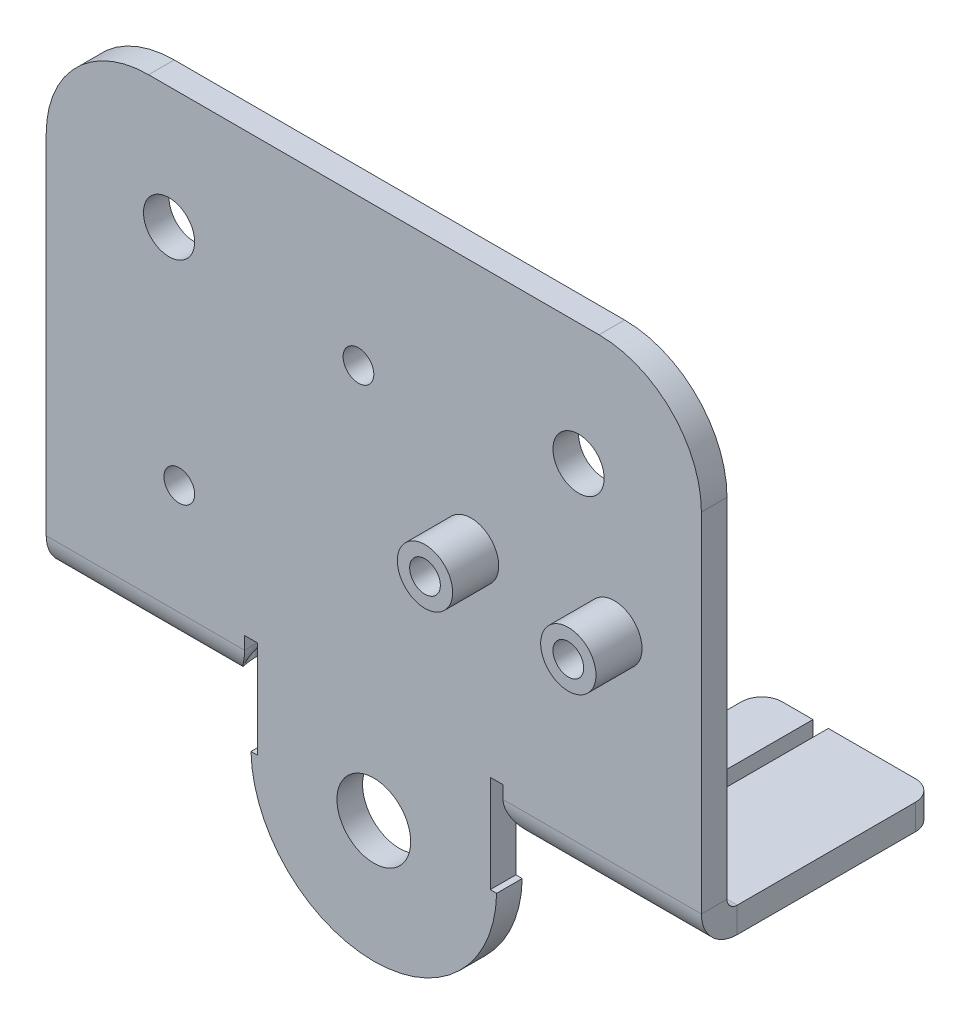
ISO-10303-21;
HEADER;
FILE_DESCRIPTION(('STEP AP214'),'2;1');
FILE_NAME('part.step','',(''),(''),'','','');
FILE_SCHEMA(('AUTOMOTIVE_DESIGN { 1 0 10303 214 1 1 1 1 }'));
ENDSEC;
DATA;
#1=APPLICATION_CONTEXT('core data for automotive mechanical design processes');
#2=APPLICATION_PROTOCOL_DEFINITION('international standard','automotive_design',2000,#1);
#3=PRODUCT_CONTEXT('',#1,'mechanical');
#4=PRODUCT('Part','Part','',(#3));
#5=PRODUCT_RELATED_PRODUCT_CATEGORY('part','',(#4));
#6=PRODUCT_DEFINITION_FORMATION('','',#4);
#7=PRODUCT_DEFINITION_CONTEXT('part definition',#1,'design');
#8=PRODUCT_DEFINITION('design','',#6,#7);
#9=PRODUCT_DEFINITION_SHAPE('','',#8);
#10=(LENGTH_UNIT() NAMED_UNIT(*) SI_UNIT(.MILLI.,.METRE.));
#11=(NAMED_UNIT(*) PLANE_ANGLE_UNIT() SI_UNIT($,.RADIAN.));
#12=(NAMED_UNIT(*) SI_UNIT($,.STERADIAN.) SOLID_ANGLE_UNIT());
#13=UNCERTAINTY_MEASURE_WITH_UNIT(LENGTH_MEASURE(1.E-05),#10,'distance_accuracy_value','');
#14=(GEOMETRIC_REPRESENTATION_CONTEXT(3) GLOBAL_UNCERTAINTY_ASSIGNED_CONTEXT((#13)) GLOBAL_UNIT_ASSIGNED_CONTEXT((#10,
#11,#12)) REPRESENTATION_CONTEXT('',''));
#15=CARTESIAN_POINT('',(0.,0.,0.));
#16=DIRECTION('',(0.,0.,1.));
#17=DIRECTION('',(1.,0.,0.));
#18=AXIS2_PLACEMENT_3D('',#15,#16,#17);
#19=CARTESIAN_POINT('',(-12.625,22.,2.5));
#20=DIRECTION('',(-1.,0.,0.));
#21=DIRECTION('',(0.,1.,0.));
#22=AXIS2_PLACEMENT_3D('',#19,#20,#21);
#23=PLANE('',#22);
#24=CARTESIAN_POINT('',(-12.625,-12.,0.));
#25=CARTESIAN_POINT('',(-12.625,-12.,2.5));
#26=B_SPLINE_CURVE_WITH_KNOTS('',1,(#24,#25),.UNSPECIFIED.,.F.,.F.,(2,2),(0.,1.),.UNSPECIFIED.);
#27=CARTESIAN_POINT('',(-12.625,-12.,0.));
#28=VERTEX_POINT('',#27);
#29=CARTESIAN_POINT('',(-12.625,-12.,2.5));
#30=VERTEX_POINT('',#29);
#31=EDGE_CURVE('E186',#28,#30,#26,.T.);
#32=ORIENTED_EDGE('',*,*,#31,.F.);
#33=DIRECTION('',(0.,1.,0.));
#34=VECTOR('',#33,1.);
#35=CARTESIAN_POINT('',(-12.625,22.,0.));
#36=LINE('',#35,#34);
#37=CARTESIAN_POINT('',(-12.625,-10.75,0.));
#38=VERTEX_POINT('',#37);
#39=EDGE_CURVE('E191',#28,#38,#36,.T.);
#40=ORIENTED_EDGE('',*,*,#39,.T.);
#41=DIRECTION('',(0.,0.,1.));
#42=VECTOR('',#41,1.);
#43=CARTESIAN_POINT('',(-12.625,-10.75,2.5));
#44=LINE('',#43,#42);
#45=CARTESIAN_POINT('',(-12.625,-10.75,2.5));
#46=VERTEX_POINT('',#45);
#47=EDGE_CURVE('E201',#38,#46,#44,.T.);
#48=ORIENTED_EDGE('',*,*,#47,.T.);
#49=DIRECTION('',(0.,1.,0.));
#50=VECTOR('',#49,1.);
#51=CARTESIAN_POINT('',(-12.625,22.,2.5));
#52=LINE('',#51,#50);
#53=EDGE_CURVE('E194',#30,#46,#52,.T.);
#54=ORIENTED_EDGE('',*,*,#53,.F.);
#55=EDGE_LOOP('',(#32,#40,#48,#54));
#56=FACE_BOUND('',#55,.T.);
#57=ADVANCED_FACE('F50',(#56),#23,.F.);
#58=CARTESIAN_POINT('',(22.,-10.75,2.5));
#59=DIRECTION('',(0.,-1.,0.));
#60=DIRECTION('',(-1.,0.,0.));
#61=AXIS2_PLACEMENT_3D('',#58,#59,#60);
#62=PLANE('',#61);
#63=ORIENTED_EDGE('',*,*,#47,.F.);
#64=DIRECTION('',(-1.,0.,0.));
#65=VECTOR('',#64,1.);
#66=CARTESIAN_POINT('',(22.,-10.75,0.));
#67=LINE('',#66,#65);
#68=CARTESIAN_POINT('',(-11.375,-10.75,0.));
#69=VERTEX_POINT('',#68);
#70=EDGE_CURVE('E227',#69,#38,#67,.T.);
#71=ORIENTED_EDGE('',*,*,#70,.F.);
#72=DIRECTION('',(0.,0.,1.));
#73=VECTOR('',#72,1.);
#74=CARTESIAN_POINT('',(-11.375,-10.75,2.5));
#75=LINE('',#74,#73);
#76=CARTESIAN_POINT('',(-11.375,-10.75,2.5));
#77=VERTEX_POINT('',#76);
#78=EDGE_CURVE('E964',#69,#77,#75,.T.);
#79=ORIENTED_EDGE('',*,*,#78,.T.);
#80=DIRECTION('',(-1.,0.,0.));
#81=VECTOR('',#80,1.);
#82=CARTESIAN_POINT('',(22.,-10.75,2.5));
#83=LINE('',#82,#81);
#84=EDGE_CURVE('E732',#77,#46,#83,.T.);
#85=ORIENTED_EDGE('',*,*,#84,.T.);
#86=EDGE_LOOP('',(#63,#71,#79,#85));
#87=FACE_BOUND('',#86,.T.);
#88=ADVANCED_FACE('F976',(#87),#62,.T.);
#89=CARTESIAN_POINT('',(-11.375,22.,2.5));
#90=DIRECTION('',(1.,0.,0.));
#91=DIRECTION('',(0.,-1.,0.));
#92=AXIS2_PLACEMENT_3D('',#89,#90,#91);
#93=PLANE('',#92);
#94=ORIENTED_EDGE('',*,*,#78,.F.);
#95=DIRECTION('',(0.,1.,0.));
#96=VECTOR('',#95,1.);
#97=CARTESIAN_POINT('',(-11.375,22.,0.));
#98=LINE('',#97,#96);
#99=CARTESIAN_POINT('',(-11.375,-20.25,0.));
#100=VERTEX_POINT('',#99);
#101=EDGE_CURVE('E229',#69,#100,#98,.F.);
#102=ORIENTED_EDGE('',*,*,#101,.T.);
#103=DIRECTION('',(0.,0.,1.));
#104=VECTOR('',#103,1.);
#105=CARTESIAN_POINT('',(-11.375,-20.25,2.5));
#106=LINE('',#105,#104);
#107=CARTESIAN_POINT('',(-11.375,-20.25,2.5));
#108=VERTEX_POINT('',#107);
#109=EDGE_CURVE('E962',#100,#108,#106,.T.);
#110=ORIENTED_EDGE('',*,*,#109,.T.);
#111=DIRECTION('',(0.,-1.,0.));
#112=VECTOR('',#111,1.);
#113=CARTESIAN_POINT('',(-11.375,22.,2.5));
#114=LINE('',#113,#112);
#115=EDGE_CURVE('E735',#77,#108,#114,.T.);
#116=ORIENTED_EDGE('',*,*,#115,.F.);
#117=EDGE_LOOP('',(#94,#102,#110,#116));
#118=FACE_BOUND('',#117,.T.);
#119=ADVANCED_FACE('F978',(#118),#93,.F.);
#120=CARTESIAN_POINT('',(22.,-20.25,2.5));
#121=DIRECTION('',(0.,-1.,0.));
#122=DIRECTION('',(-1.,0.,0.));
#123=AXIS2_PLACEMENT_3D('',#120,#121,#122);
#124=PLANE('',#123);
#125=ORIENTED_EDGE('',*,*,#109,.F.);
#126=DIRECTION('',(-1.,0.,0.));
#127=VECTOR('',#126,1.);
#128=CARTESIAN_POINT('',(22.,-20.25,0.));
#129=LINE('',#128,#127);
#130=CARTESIAN_POINT('',(-11.9973955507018,-20.25,0.));
#131=VERTEX_POINT('',#130);
#132=EDGE_CURVE('E228',#100,#131,#129,.T.);
#133=ORIENTED_EDGE('',*,*,#132,.T.);
#134=DIRECTION('',(0.,0.,1.));
#135=VECTOR('',#134,1.);
#136=CARTESIAN_POINT('',(-11.9973955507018,-20.25,2.5));
#137=LINE('',#136,#135);
#138=CARTESIAN_POINT('',(-11.9973955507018,-20.25,2.5));
#139=VERTEX_POINT('',#138);
#140=EDGE_CURVE('E960',#131,#139,#137,.T.);
#141=ORIENTED_EDGE('',*,*,#140,.T.);
#142=DIRECTION('',(-1.,0.,0.));
#143=VECTOR('',#142,1.);
#144=CARTESIAN_POINT('',(22.,-20.25,2.5));
#145=LINE('',#144,#143);
#146=EDGE_CURVE('E550',#108,#139,#145,.T.);
#147=ORIENTED_EDGE('',*,*,#146,.F.);
#148=EDGE_LOOP('',(#125,#133,#141,#147));
#149=FACE_BOUND('',#148,.T.);
#150=ADVANCED_FACE('F983',(#149),#124,.F.);
#151=CARTESIAN_POINT('',(0.,-20.,2.5));
#152=DIRECTION('',(0.,0.,-1.));
#153=DIRECTION('',(-1.,0.,0.));
#154=AXIS2_PLACEMENT_3D('',#151,#152,#153);
#155=CYLINDRICAL_SURFACE('',#154,12.);
#156=ORIENTED_EDGE('',*,*,#140,.F.);
#157=CARTESIAN_POINT('',(0.,-20.,0.));
#158=DIRECTION('',(0.,0.,-1.));
#159=DIRECTION('',(-1.,0.,0.));
#160=AXIS2_PLACEMENT_3D('',#157,#158,#159);
#161=CIRCLE('',#160,12.);
#162=CARTESIAN_POINT('',(11.9973955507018,-20.25,0.));
#163=VERTEX_POINT('',#162);
#164=EDGE_CURVE('E772',#163,#131,#161,.T.);
#165=ORIENTED_EDGE('',*,*,#164,.F.);
#166=DIRECTION('',(0.,0.,1.));
#167=VECTOR('',#166,1.);
#168=CARTESIAN_POINT('',(11.9973955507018,-20.25,2.5));
#169=LINE('',#168,#167);
#170=CARTESIAN_POINT('',(11.9973955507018,-20.25,2.5));
#171=VERTEX_POINT('',#170);
#172=EDGE_CURVE('E955',#163,#171,#169,.T.);
#173=ORIENTED_EDGE('',*,*,#172,.T.);
#174=CARTESIAN_POINT('',(0.,-20.,2.5));
#175=DIRECTION('',(0.,0.,-1.));
#176=DIRECTION('',(-1.,0.,0.));
#177=AXIS2_PLACEMENT_3D('',#174,#175,#176);
#178=CIRCLE('',#177,12.);
#179=EDGE_CURVE('E703',#171,#139,#178,.T.);
#180=ORIENTED_EDGE('',*,*,#179,.T.);
#181=EDGE_LOOP('',(#156,#165,#173,#180));
#182=FACE_BOUND('',#181,.T.);
#183=ADVANCED_FACE('F991',(#182),#155,.T.);
#184=CARTESIAN_POINT('',(22.,-20.25,2.5));
#185=DIRECTION('',(0.,-1.,0.));
#186=DIRECTION('',(-1.,0.,0.));
#187=AXIS2_PLACEMENT_3D('',#184,#185,#186);
#188=PLANE('',#187);
#189=ORIENTED_EDGE('',*,*,#172,.F.);
#190=DIRECTION('',(-1.,0.,0.));
#191=VECTOR('',#190,1.);
#192=CARTESIAN_POINT('',(22.,-20.25,0.));
#193=LINE('',#192,#191);
#194=CARTESIAN_POINT('',(11.375,-20.25,0.));
#195=VERTEX_POINT('',#194);
#196=EDGE_CURVE('E811',#163,#195,#193,.T.);
#197=ORIENTED_EDGE('',*,*,#196,.T.);
#198=DIRECTION('',(0.,0.,1.));
#199=VECTOR('',#198,1.);
#200=CARTESIAN_POINT('',(11.375,-20.25,2.5));
#201=LINE('',#200,#199);
#202=CARTESIAN_POINT('',(11.375,-20.25,2.5));
#203=VERTEX_POINT('',#202);
#204=EDGE_CURVE('E953',#195,#203,#201,.T.);
#205=ORIENTED_EDGE('',*,*,#204,.T.);
#206=DIRECTION('',(-1.,0.,0.));
#207=VECTOR('',#206,1.);
#208=CARTESIAN_POINT('',(22.,-20.25,2.5));
#209=LINE('',#208,#207);
#210=EDGE_CURVE('E729',#171,#203,#209,.T.);
#211=ORIENTED_EDGE('',*,*,#210,.F.);
#212=EDGE_LOOP('',(#189,#197,#205,#211));
#213=FACE_BOUND('',#212,.T.);
#214=ADVANCED_FACE('F989',(#213),#188,.F.);
#215=CARTESIAN_POINT('',(11.375,22.,2.5));
#216=DIRECTION('',(-1.,0.,0.));
#217=DIRECTION('',(0.,1.,0.));
#218=AXIS2_PLACEMENT_3D('',#215,#216,#217);
#219=PLANE('',#218);
#220=ORIENTED_EDGE('',*,*,#204,.F.);
#221=DIRECTION('',(0.,1.,0.));
#222=VECTOR('',#221,1.);
#223=CARTESIAN_POINT('',(11.375,22.,0.));
#224=LINE('',#223,#222);
#225=CARTESIAN_POINT('',(11.375,-10.75,0.));
#226=VERTEX_POINT('',#225);
#227=EDGE_CURVE('E465',#195,#226,#224,.T.);
#228=ORIENTED_EDGE('',*,*,#227,.T.);
#229=DIRECTION('',(0.,0.,1.));
#230=VECTOR('',#229,1.);
#231=CARTESIAN_POINT('',(11.375,-10.75,2.5));
#232=LINE('',#231,#230);
#233=CARTESIAN_POINT('',(11.375,-10.75,2.5));
#234=VERTEX_POINT('',#233);
#235=EDGE_CURVE('E950',#226,#234,#232,.T.);
#236=ORIENTED_EDGE('',*,*,#235,.T.);
#237=DIRECTION('',(0.,1.,0.));
#238=VECTOR('',#237,1.);
#239=CARTESIAN_POINT('',(11.375,22.,2.5));
#240=LINE('',#239,#238);
#241=EDGE_CURVE('E434',#203,#234,#240,.T.);
#242=ORIENTED_EDGE('',*,*,#241,.F.);
#243=EDGE_LOOP('',(#220,#228,#236,#242));
#244=FACE_BOUND('',#243,.T.);
#245=ADVANCED_FACE('F990',(#244),#219,.F.);
#246=CARTESIAN_POINT('',(22.,-10.75,2.5));
#247=DIRECTION('',(0.,-1.,0.));
#248=DIRECTION('',(-1.,0.,0.));
#249=AXIS2_PLACEMENT_3D('',#246,#247,#248);
#250=PLANE('',#249);
#251=ORIENTED_EDGE('',*,*,#235,.F.);
#252=DIRECTION('',(-1.,0.,0.));
#253=VECTOR('',#252,1.);
#254=CARTESIAN_POINT('',(22.,-10.75,0.));
#255=LINE('',#254,#253);
#256=CARTESIAN_POINT('',(12.625,-10.75,0.));
#257=VERTEX_POINT('',#256);
#258=EDGE_CURVE('E466',#257,#226,#255,.T.);
#259=ORIENTED_EDGE('',*,*,#258,.F.);
#260=DIRECTION('',(0.,0.,1.));
#261=VECTOR('',#260,1.);
#262=CARTESIAN_POINT('',(12.625,-10.75,2.5));
#263=LINE('',#262,#261);
#264=CARTESIAN_POINT('',(12.625,-10.75,2.5));
#265=VERTEX_POINT('',#264);
#266=EDGE_CURVE('E487',#257,#265,#263,.T.);
#267=ORIENTED_EDGE('',*,*,#266,.T.);
#268=DIRECTION('',(-1.,0.,0.));
#269=VECTOR('',#268,1.);
#270=CARTESIAN_POINT('',(22.,-10.75,2.5));
#271=LINE('',#270,#269);
#272=EDGE_CURVE('E435',#265,#234,#271,.T.);
#273=ORIENTED_EDGE('',*,*,#272,.T.);
#274=EDGE_LOOP('',(#251,#259,#267,#273));
#275=FACE_BOUND('',#274,.T.);
#276=ADVANCED_FACE('F949',(#275),#250,.T.);
#277=CARTESIAN_POINT('',(12.625,22.,2.5));
#278=DIRECTION('',(1.,0.,0.));
#279=DIRECTION('',(0.,-1.,0.));
#280=AXIS2_PLACEMENT_3D('',#277,#278,#279);
#281=PLANE('',#280);
#282=ORIENTED_EDGE('',*,*,#266,.F.);
#283=DIRECTION('',(0.,1.,0.));
#284=VECTOR('',#283,1.);
#285=CARTESIAN_POINT('',(12.625,22.,0.));
#286=LINE('',#285,#284);
#287=CARTESIAN_POINT('',(12.625,-12.,0.));
#288=VERTEX_POINT('',#287);
#289=EDGE_CURVE('E463',#257,#288,#286,.F.);
#290=ORIENTED_EDGE('',*,*,#289,.T.);
#291=CARTESIAN_POINT('',(12.625,-12.,2.5));
#292=CARTESIAN_POINT('',(12.625,-12.,0.));
#293=B_SPLINE_CURVE_WITH_KNOTS('',1,(#291,#292),.UNSPECIFIED.,.F.,.F.,(2,2),(0.,1.),.UNSPECIFIED.);
#294=CARTESIAN_POINT('',(12.625,-12.,2.5));
#295=VERTEX_POINT('',#294);
#296=EDGE_CURVE('E468',#288,#295,#293,.F.);
#297=ORIENTED_EDGE('',*,*,#296,.T.);
#298=DIRECTION('',(0.,-1.,0.));
#299=VECTOR('',#298,1.);
#300=CARTESIAN_POINT('',(12.625,22.,2.5));
#301=LINE('',#300,#299);
#302=EDGE_CURVE('E431',#265,#295,#301,.T.);
#303=ORIENTED_EDGE('',*,*,#302,.F.);
#304=EDGE_LOOP('',(#282,#290,#297,#303));
#305=FACE_BOUND('',#304,.T.);
#306=ADVANCED_FACE('F347',(#305),#281,.F.);
#307=CARTESIAN_POINT('',(15.,-15.5,-1.));
#308=CARTESIAN_POINT('',(15.,-15.5,-0.542421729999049));
#309=CARTESIAN_POINT('',(14.8515625,-15.4091250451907,-0.0846635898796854));
#310=CARTESIAN_POINT('',(14.40625,-15.0585868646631,0.762106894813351));
#311=CARTESIAN_POINT('',(14.109375,-14.7990619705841,1.15068549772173));
#312=CARTESIAN_POINT('',(13.515625,-14.1506854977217,1.79906197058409));
#313=CARTESIAN_POINT('',(13.21875,-13.7621068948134,2.05858686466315));
#314=CARTESIAN_POINT('',(12.7734375,-12.9153364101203,2.40912504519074));
#315=CARTESIAN_POINT('',(12.625,-12.457578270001,2.5));
#316=CARTESIAN_POINT('',(12.625,-12.,2.5));
#317=CARTESIAN_POINT('',(15.,-13.,-1.));
#318=CARTESIAN_POINT('',(15.,-13.,-0.869263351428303));
#319=CARTESIAN_POINT('',(14.8515625,-12.9740357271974,-0.738475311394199));
#320=CARTESIAN_POINT('',(14.40625,-12.8738819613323,-0.496540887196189));
#321=CARTESIAN_POINT('',(14.109375,-12.7997319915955,-0.385518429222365));
#322=CARTESIAN_POINT('',(13.515625,-12.6144815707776,-0.200268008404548));
#323=CARTESIAN_POINT('',(13.21875,-12.5034591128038,-0.126118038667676));
#324=CARTESIAN_POINT('',(12.7734375,-12.2615246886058,-0.0259642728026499));
#325=CARTESIAN_POINT('',(12.625,-12.1307366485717,0.));
#326=CARTESIAN_POINT('',(12.625,-12.,0.));
#327=B_SPLINE_SURFACE_WITH_KNOTS('',1,3,((#307,#308,#309,#310,#311,#312,#313,#314,#315,#316),
(#317,#318,#319,#320,#321,#322,#323,#324,#325,#326)),.UNSPECIFIED.,.F.,.F.,.F.,(2,2),(4,2,2,2,
4),(0.,1.),(0.,0.25,0.5,0.75,1.),.UNSPECIFIED.);
#328=CARTESIAN_POINT('',(12.625,-12.,0.));
#329=CARTESIAN_POINT('',(12.625,-12.1307366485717,0.));
#330=CARTESIAN_POINT('',(12.7734375,-12.2615246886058,-0.0259642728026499));
#331=CARTESIAN_POINT('',(13.21875,-12.5034591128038,-0.126118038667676));
#332=CARTESIAN_POINT('',(13.515625,-12.6144815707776,-0.200268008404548));
#333=CARTESIAN_POINT('',(14.109375,-12.7997319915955,-0.385518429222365));
#334=CARTESIAN_POINT('',(14.40625,-12.8738819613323,-0.496540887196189));
#335=CARTESIAN_POINT('',(14.8515625,-12.9740357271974,-0.738475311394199));
#336=CARTESIAN_POINT('',(15.,-13.,-0.869263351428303));
#337=CARTESIAN_POINT('',(15.,-13.,-1.));
#338=B_SPLINE_CURVE_WITH_KNOTS('',3,(#328,#329,#330,#331,#332,#333,#334,#335,#336,#337),
.UNSPECIFIED.,.F.,.F.,(4,2,2,2,4),(0.,0.25,0.5,0.75,1.),.UNSPECIFIED.);
#339=CARTESIAN_POINT('',(15.,-13.,-1.));
#340=VERTEX_POINT('',#339);
#341=EDGE_CURVE('E449',#288,#340,#338,.T.);
#342=CARTESIAN_POINT('',(15.,-13.,-1.));
#343=CARTESIAN_POINT('',(15.,-15.5,-1.));
#344=B_SPLINE_CURVE_WITH_KNOTS('',1,(#342,#343),.UNSPECIFIED.,.F.,.F.,(2,2),(0.,1.),.UNSPECIFIED.);
#345=CARTESIAN_POINT('',(15.,-15.5,-1.));
#346=VERTEX_POINT('',#345);
#347=EDGE_CURVE('E321',#340,#346,#344,.T.);
#348=CARTESIAN_POINT('',(15.,-15.5,-1.));
#349=CARTESIAN_POINT('',(15.,-15.5,-0.542421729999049));
#350=CARTESIAN_POINT('',(14.8515625,-15.4091250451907,-0.0846635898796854));
#351=CARTESIAN_POINT('',(14.40625,-15.0585868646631,0.762106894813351));
#352=CARTESIAN_POINT('',(14.109375,-14.7990619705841,1.15068549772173));
#353=CARTESIAN_POINT('',(13.515625,-14.1506854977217,1.79906197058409));
#354=CARTESIAN_POINT('',(13.21875,-13.7621068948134,2.05858686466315));
#355=CARTESIAN_POINT('',(12.7734375,-12.9153364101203,2.40912504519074));
#356=CARTESIAN_POINT('',(12.625,-12.457578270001,2.5));
#357=CARTESIAN_POINT('',(12.625,-12.,2.5));
#358=B_SPLINE_CURVE_WITH_KNOTS('',3,(#348,#349,#350,#351,#352,#353,#354,#355,#356,#357),
.UNSPECIFIED.,.F.,.F.,(4,2,2,2,4),(0.,0.25,0.5,0.75,1.),.UNSPECIFIED.);
#359=EDGE_CURVE('E427',#295,#346,#358,.F.);
#360=ORIENTED_EDGE('',*,*,#296,.F.);
#361=ORIENTED_EDGE('',*,*,#341,.T.);
#362=ORIENTED_EDGE('',*,*,#347,.T.);
#363=ORIENTED_EDGE('',*,*,#359,.F.);
#364=EDGE_LOOP('',(#360,#361,#362,#363));
#365=FACE_BOUND('',#364,.T.);
#366=ADVANCED_FACE('F334',(#365),#327,.F.);
#367=CARTESIAN_POINT('',(15.,-15.5,0.));
#368=DIRECTION('',(-1.,0.,0.));
#369=DIRECTION('',(0.,0.,-1.));
#370=AXIS2_PLACEMENT_3D('',#367,#368,#369);
#371=PLANE('',#370);
#372=ORIENTED_EDGE('',*,*,#347,.F.);
#373=DIRECTION('',(0.,0.,1.));
#374=VECTOR('',#373,1.);
#375=CARTESIAN_POINT('',(15.,-13.,2.5));
#376=LINE('',#375,#374);
#377=CARTESIAN_POINT('',(15.,-13.,-18.4));
#378=VERTEX_POINT('',#377);
#379=EDGE_CURVE('E787',#340,#378,#376,.F.);
#380=ORIENTED_EDGE('',*,*,#379,.T.);
#381=DIRECTION('',(0.,-1.,0.));
#382=VECTOR('',#381,1.);
#383=CARTESIAN_POINT('',(15.,-15.5,-18.4));
#384=LINE('',#383,#382);
#385=CARTESIAN_POINT('',(15.,-15.5,-18.4));
#386=VERTEX_POINT('',#385);
#387=EDGE_CURVE('E318',#378,#386,#384,.T.);
#388=ORIENTED_EDGE('',*,*,#387,.T.);
#389=DIRECTION('',(0.,0.,-1.));
#390=VECTOR('',#389,1.);
#391=CARTESIAN_POINT('',(15.,-15.5,0.));
#392=LINE('',#391,#390);
#393=EDGE_CURVE('E415',#346,#386,#392,.T.);
#394=ORIENTED_EDGE('',*,*,#393,.F.);
#395=EDGE_LOOP('',(#372,#380,#388,#394));
#396=FACE_BOUND('',#395,.T.);
#397=ADVANCED_FACE('F346',(#396),#371,.T.);
#398=CARTESIAN_POINT('',(17.,-15.5,-18.4));
#399=DIRECTION('',(0.,-1.,0.));
#400=DIRECTION('',(1.,0.,0.));
#401=AXIS2_PLACEMENT_3D('',#398,#399,#400);
#402=CYLINDRICAL_SURFACE('',#401,2.);
#403=ORIENTED_EDGE('',*,*,#387,.F.);
#404=CARTESIAN_POINT('',(17.,-13.,-18.4));
#405=DIRECTION('',(0.,-1.,0.));
#406=DIRECTION('',(0.,0.,-1.));
#407=AXIS2_PLACEMENT_3D('',#404,#405,#406);
#408=CIRCLE('',#407,2.);
#409=CARTESIAN_POINT('',(17.,-13.,-20.4));
#410=VERTEX_POINT('',#409);
#411=EDGE_CURVE('E804',#378,#410,#408,.T.);
#412=ORIENTED_EDGE('',*,*,#411,.T.);
#413=DIRECTION('',(0.,-1.,0.));
#414=VECTOR('',#413,1.);
#415=CARTESIAN_POINT('',(17.,-15.5,-20.4));
#416=LINE('',#415,#414);
#417=CARTESIAN_POINT('',(17.,-15.5,-20.4));
#418=VERTEX_POINT('',#417);
#419=EDGE_CURVE('E315',#410,#418,#416,.T.);
#420=ORIENTED_EDGE('',*,*,#419,.T.);
#421=CARTESIAN_POINT('',(17.,-15.5,-18.4));
#422=DIRECTION('',(0.,-1.,0.));
#423=DIRECTION('',(0.,0.,-1.));
#424=AXIS2_PLACEMENT_3D('',#421,#422,#423);
#425=CIRCLE('',#424,2.);
#426=EDGE_CURVE('E689',#386,#418,#425,.T.);
#427=ORIENTED_EDGE('',*,*,#426,.F.);
#428=EDGE_LOOP('',(#403,#412,#420,#427));
#429=FACE_BOUND('',#428,.T.);
#430=ADVANCED_FACE('F831',(#429),#402,.T.);
#431=CARTESIAN_POINT('',(17.,-15.5,-20.4));
#432=DIRECTION('',(0.,0.,-1.));
#433=DIRECTION('',(1.,0.,0.));
#434=AXIS2_PLACEMENT_3D('',#431,#432,#433);
#435=PLANE('',#434);
#436=ORIENTED_EDGE('',*,*,#419,.F.);
#437=DIRECTION('',(1.,0.,0.));
#438=VECTOR('',#437,1.);
#439=CARTESIAN_POINT('',(32.,-13.,-20.4));
#440=LINE('',#439,#438);
#441=CARTESIAN_POINT('',(20.,-13.,-20.4));
#442=VERTEX_POINT('',#441);
#443=EDGE_CURVE('E782',#410,#442,#440,.T.);
#444=ORIENTED_EDGE('',*,*,#443,.T.);
#445=DIRECTION('',(0.,-1.,0.));
#446=VECTOR('',#445,1.);
#447=CARTESIAN_POINT('',(20.,-15.5,-20.4));
#448=LINE('',#447,#446);
#449=CARTESIAN_POINT('',(20.,-15.5,-20.4));
#450=VERTEX_POINT('',#449);
#451=EDGE_CURVE('E312',#442,#450,#448,.T.);
#452=ORIENTED_EDGE('',*,*,#451,.T.);
#453=DIRECTION('',(1.,0.,0.));
#454=VECTOR('',#453,1.);
#455=CARTESIAN_POINT('',(17.,-15.5,-20.4));
#456=LINE('',#455,#454);
#457=EDGE_CURVE('E687',#418,#450,#456,.T.);
#458=ORIENTED_EDGE('',*,*,#457,.F.);
#459=EDGE_LOOP('',(#436,#444,#452,#458));
#460=FACE_BOUND('',#459,.T.);
#461=ADVANCED_FACE('F841',(#460),#435,.T.);
#462=CARTESIAN_POINT('',(20.,-15.5,-9.4));
#463=DIRECTION('',(-1.,0.,0.));
#464=DIRECTION('',(0.,0.,-1.));
#465=AXIS2_PLACEMENT_3D('',#462,#463,#464);
#466=PLANE('',#465);
#467=ORIENTED_EDGE('',*,*,#451,.F.);
#468=DIRECTION('',(0.,0.,1.));
#469=VECTOR('',#468,1.);
#470=CARTESIAN_POINT('',(20.,-13.,2.5));
#471=LINE('',#470,#469);
#472=CARTESIAN_POINT('',(20.,-13.,-9.4));
#473=VERTEX_POINT('',#472);
#474=EDGE_CURVE('E237',#473,#442,#471,.F.);
#475=ORIENTED_EDGE('',*,*,#474,.F.);
#476=DIRECTION('',(0.,-1.,0.));
#477=VECTOR('',#476,1.);
#478=CARTESIAN_POINT('',(20.,-15.5,-9.4));
#479=LINE('',#478,#477);
#480=CARTESIAN_POINT('',(20.,-15.5,-9.4));
#481=VERTEX_POINT('',#480);
#482=EDGE_CURVE('E309',#473,#481,#479,.T.);
#483=ORIENTED_EDGE('',*,*,#482,.T.);
#484=DIRECTION('',(0.,0.,-1.));
#485=VECTOR('',#484,1.);
#486=CARTESIAN_POINT('',(20.,-15.5,-9.4));
#487=LINE('',#486,#485);
#488=EDGE_CURVE('E676',#481,#450,#487,.T.);
#489=ORIENTED_EDGE('',*,*,#488,.T.);
#490=EDGE_LOOP('',(#467,#475,#483,#489));
#491=FACE_BOUND('',#490,.T.);
#492=ADVANCED_FACE('F846',(#491),#466,.F.);
#493=CARTESIAN_POINT('',(21.5,-15.5,-9.4));
#494=DIRECTION('',(0.,0.,1.));
#495=DIRECTION('',(-1.,0.,0.));
#496=AXIS2_PLACEMENT_3D('',#493,#494,#495);
#497=PLANE('',#496);
#498=ORIENTED_EDGE('',*,*,#482,.F.);
#499=DIRECTION('',(1.,0.,0.));
#500=VECTOR('',#499,1.);
#501=CARTESIAN_POINT('',(32.,-13.,-9.4));
#502=LINE('',#501,#500);
#503=CARTESIAN_POINT('',(21.5,-13.,-9.4));
#504=VERTEX_POINT('',#503);
#505=EDGE_CURVE('E797',#504,#473,#502,.F.);
#506=ORIENTED_EDGE('',*,*,#505,.F.);
#507=DIRECTION('',(0.,-1.,0.));
#508=VECTOR('',#507,1.);
#509=CARTESIAN_POINT('',(21.5,-15.5,-9.4));
#510=LINE('',#509,#508);
#511=CARTESIAN_POINT('',(21.5,-15.5,-9.4));
#512=VERTEX_POINT('',#511);
#513=EDGE_CURVE('E306',#504,#512,#510,.T.);
#514=ORIENTED_EDGE('',*,*,#513,.T.);
#515=DIRECTION('',(-1.,0.,0.));
#516=VECTOR('',#515,1.);
#517=CARTESIAN_POINT('',(21.5,-15.5,-9.4));
#518=LINE('',#517,#516);
#519=EDGE_CURVE('E679',#512,#481,#518,.T.);
#520=ORIENTED_EDGE('',*,*,#519,.T.);
#521=EDGE_LOOP('',(#498,#506,#514,#520));
#522=FACE_BOUND('',#521,.T.);
#523=ADVANCED_FACE('F851',(#522),#497,.F.);
#524=CARTESIAN_POINT('',(21.5,-15.5,-20.4));
#525=DIRECTION('',(1.,0.,0.));
#526=DIRECTION('',(0.,0.,1.));
#527=AXIS2_PLACEMENT_3D('',#524,#525,#526);
#528=PLANE('',#527);
#529=ORIENTED_EDGE('',*,*,#513,.F.);
#530=DIRECTION('',(0.,0.,1.));
#531=VECTOR('',#530,1.);
#532=CARTESIAN_POINT('',(21.5,-13.,2.5));
#533=LINE('',#532,#531);
#534=CARTESIAN_POINT('',(21.5,-13.,-20.4));
#535=VERTEX_POINT('',#534);
#536=EDGE_CURVE('E794',#535,#504,#533,.T.);
#537=ORIENTED_EDGE('',*,*,#536,.F.);
#538=DIRECTION('',(0.,-1.,0.));
#539=VECTOR('',#538,1.);
#540=CARTESIAN_POINT('',(21.5,-15.5,-20.4));
#541=LINE('',#540,#539);
#542=CARTESIAN_POINT('',(21.5,-15.5,-20.4));
#543=VERTEX_POINT('',#542);
#544=EDGE_CURVE('E303',#535,#543,#541,.T.);
#545=ORIENTED_EDGE('',*,*,#544,.T.);
#546=DIRECTION('',(0.,0.,1.));
#547=VECTOR('',#546,1.);
#548=CARTESIAN_POINT('',(21.5,-15.5,-20.4));
#549=LINE('',#548,#547);
#550=EDGE_CURVE('E682',#543,#512,#549,.T.);
#551=ORIENTED_EDGE('',*,*,#550,.T.);
#552=EDGE_LOOP('',(#529,#537,#545,#551));
#553=FACE_BOUND('',#552,.T.);
#554=ADVANCED_FACE('F860',(#553),#528,.F.);
#555=ORIENTED_EDGE('',*,*,#544,.F.);
#556=DIRECTION('',(1.,0.,0.));
#557=VECTOR('',#556,1.);
#558=CARTESIAN_POINT('',(32.,-13.,-20.4));
#559=LINE('',#558,#557);
#560=CARTESIAN_POINT('',(30.,-13.,-20.4));
#561=VERTEX_POINT('',#560);
#562=EDGE_CURVE('E791',#535,#561,#559,.T.);
#563=ORIENTED_EDGE('',*,*,#562,.T.);
#564=DIRECTION('',(0.,-1.,0.));
#565=VECTOR('',#564,1.);
#566=CARTESIAN_POINT('',(30.,-15.5,-20.4));
#567=LINE('',#566,#565);
#568=CARTESIAN_POINT('',(30.,-15.5,-20.4));
#569=VERTEX_POINT('',#568);
#570=EDGE_CURVE('E300',#561,#569,#567,.T.);
#571=ORIENTED_EDGE('',*,*,#570,.T.);
#572=EDGE_CURVE('E685',#543,#569,#456,.T.);
#573=ORIENTED_EDGE('',*,*,#572,.F.);
#574=EDGE_LOOP('',(#555,#563,#571,#573));
#575=FACE_BOUND('',#574,.T.);
#576=ADVANCED_FACE('F864',(#575),#435,.T.);
#577=CARTESIAN_POINT('',(30.,-15.5,-18.4));
#578=DIRECTION('',(0.,-1.,0.));
#579=DIRECTION('',(1.,0.,0.));
#580=AXIS2_PLACEMENT_3D('',#577,#578,#579);
#581=CYLINDRICAL_SURFACE('',#580,2.);
#582=ORIENTED_EDGE('',*,*,#570,.F.);
#583=CARTESIAN_POINT('',(30.,-13.,-18.4));
#584=DIRECTION('',(0.,-1.,0.));
#585=DIRECTION('',(0.,0.,-1.));
#586=AXIS2_PLACEMENT_3D('',#583,#584,#585);
#587=CIRCLE('',#586,2.);
#588=CARTESIAN_POINT('',(32.,-13.,-18.4));
#589=VERTEX_POINT('',#588);
#590=EDGE_CURVE('E788',#561,#589,#587,.T.);
#591=ORIENTED_EDGE('',*,*,#590,.T.);
#592=DIRECTION('',(0.,-1.,0.));
#593=VECTOR('',#592,1.);
#594=CARTESIAN_POINT('',(32.,-15.5,-18.4));
#595=LINE('',#594,#593);
#596=CARTESIAN_POINT('',(32.,-15.5,-18.4));
#597=VERTEX_POINT('',#596);
#598=EDGE_CURVE('E297',#589,#597,#595,.T.);
#599=ORIENTED_EDGE('',*,*,#598,.T.);
#600=CARTESIAN_POINT('',(30.,-15.5,-18.4));
#601=DIRECTION('',(0.,-1.,0.));
#602=DIRECTION('',(0.,0.,-1.));
#603=AXIS2_PLACEMENT_3D('',#600,#601,#602);
#604=CIRCLE('',#603,2.);
#605=EDGE_CURVE('E538',#569,#597,#604,.T.);
#606=ORIENTED_EDGE('',*,*,#605,.F.);
#607=EDGE_LOOP('',(#582,#591,#599,#606));
#608=FACE_BOUND('',#607,.T.);
#609=ADVANCED_FACE('F867',(#608),#581,.T.);
#610=CARTESIAN_POINT('',(32.,-15.5,2.5));
#611=DIRECTION('',(-1.,0.,0.));
#612=DIRECTION('',(0.,0.,-1.));
#613=AXIS2_PLACEMENT_3D('',#610,#611,#612);
#614=PLANE('',#613);
#615=ORIENTED_EDGE('',*,*,#598,.F.);
#616=DIRECTION('',(0.,0.,1.));
#617=VECTOR('',#616,1.);
#618=CARTESIAN_POINT('',(32.,-13.,2.5));
#619=LINE('',#618,#617);
#620=CARTESIAN_POINT('',(32.,-13.,-1.));
#621=VERTEX_POINT('',#620);
#622=EDGE_CURVE('E530',#621,#589,#619,.F.);
#623=ORIENTED_EDGE('',*,*,#622,.F.);
#624=DIRECTION('',(0.,-1.,0.));
#625=VECTOR('',#624,1.);
#626=CARTESIAN_POINT('',(32.,-15.5,-1.));
#627=LINE('',#626,#625);
#628=CARTESIAN_POINT('',(32.,-15.5,-1.));
#629=VERTEX_POINT('',#628);
#630=EDGE_CURVE('E294',#621,#629,#627,.T.);
#631=ORIENTED_EDGE('',*,*,#630,.T.);
#632=DIRECTION('',(0.,0.,-1.));
#633=VECTOR('',#632,1.);
#634=CARTESIAN_POINT('',(32.,-15.5,2.5));
#635=LINE('',#634,#633);
#636=EDGE_CURVE('E528',#629,#597,#635,.T.);
#637=ORIENTED_EDGE('',*,*,#636,.T.);
#638=EDGE_LOOP('',(#615,#623,#631,#637));
#639=FACE_BOUND('',#638,.T.);
#640=ADVANCED_FACE('F526',(#639),#614,.F.);
#641=CARTESIAN_POINT('',(32.,-12.,-1.));
#642=DIRECTION('',(-1.,0.,0.));
#643=DIRECTION('',(0.,0.,1.));
#644=AXIS2_PLACEMENT_3D('',#641,#642,#643);
#645=PLANE('',#644);
#646=ORIENTED_EDGE('',*,*,#630,.F.);
#647=CARTESIAN_POINT('',(32.,-12.,-1.));
#648=DIRECTION('',(1.,0.,0.));
#649=DIRECTION('',(0.,1.,0.));
#650=AXIS2_PLACEMENT_3D('',#647,#648,#649);
#651=CIRCLE('',#650,1.);
#652=CARTESIAN_POINT('',(32.,-12.,0.));
#653=VERTEX_POINT('',#652);
#654=EDGE_CURVE('E769',#621,#653,#651,.F.);
#655=ORIENTED_EDGE('',*,*,#654,.T.);
#656=DIRECTION('',(0.,0.,1.));
#657=VECTOR('',#656,1.);
#658=CARTESIAN_POINT('',(32.,-12.,2.5));
#659=LINE('',#658,#657);
#660=CARTESIAN_POINT('',(32.,-12.,2.5));
#661=VERTEX_POINT('',#660);
#662=EDGE_CURVE('E72',#653,#661,#659,.T.);
#663=ORIENTED_EDGE('',*,*,#662,.T.);
#664=CARTESIAN_POINT('',(32.,-12.,-1.));
#665=DIRECTION('',(1.,0.,0.));
#666=DIRECTION('',(0.,0.,-1.));
#667=AXIS2_PLACEMENT_3D('',#664,#665,#666);
#668=CIRCLE('',#667,3.5);
#669=EDGE_CURVE('E471',#629,#661,#668,.F.);
#670=ORIENTED_EDGE('',*,*,#669,.F.);
#671=EDGE_LOOP('',(#646,#655,#663,#670));
#672=FACE_BOUND('',#671,.T.);
#673=ADVANCED_FACE('F540',(#672),#645,.F.);
#674=CARTESIAN_POINT('',(32.,22.,2.5));
#675=DIRECTION('',(1.,0.,0.));
#676=DIRECTION('',(0.,-1.,0.));
#677=AXIS2_PLACEMENT_3D('',#674,#675,#676);
#678=PLANE('',#677);
#679=ORIENTED_EDGE('',*,*,#662,.F.);
#680=DIRECTION('',(0.,1.,0.));
#681=VECTOR('',#680,1.);
#682=CARTESIAN_POINT('',(32.,22.,0.));
#683=LINE('',#682,#681);
#684=CARTESIAN_POINT('',(32.,22.,0.));
#685=VERTEX_POINT('',#684);
#686=EDGE_CURVE('E758',#685,#653,#683,.F.);
#687=ORIENTED_EDGE('',*,*,#686,.F.);
#688=DIRECTION('',(0.,0.,1.));
#689=VECTOR('',#688,1.);
#690=CARTESIAN_POINT('',(32.,22.,2.5));
#691=LINE('',#690,#689);
#692=CARTESIAN_POINT('',(32.,22.,2.5));
#693=VERTEX_POINT('',#692);
#694=EDGE_CURVE('E290',#685,#693,#691,.T.);
#695=ORIENTED_EDGE('',*,*,#694,.T.);
#696=DIRECTION('',(0.,-1.,0.));
#697=VECTOR('',#696,1.);
#698=CARTESIAN_POINT('',(32.,22.,2.5));
#699=LINE('',#698,#697);
#700=EDGE_CURVE('E478',#693,#661,#699,.T.);
#701=ORIENTED_EDGE('',*,*,#700,.T.);
#702=EDGE_LOOP('',(#679,#687,#695,#701));
#703=FACE_BOUND('',#702,.T.);
#704=ADVANCED_FACE('F947',(#703),#678,.T.);
#705=CARTESIAN_POINT('',(22.,22.,2.5));
#706=DIRECTION('',(0.,0.,-1.));
#707=DIRECTION('',(-1.,0.,0.));
#708=AXIS2_PLACEMENT_3D('',#705,#706,#707);
#709=CYLINDRICAL_SURFACE('',#708,10.);
#710=ORIENTED_EDGE('',*,*,#694,.F.);
#711=CARTESIAN_POINT('',(22.,22.,0.));
#712=DIRECTION('',(0.,0.,-1.));
#713=DIRECTION('',(-1.,0.,0.));
#714=AXIS2_PLACEMENT_3D('',#711,#712,#713);
#715=CIRCLE('',#714,10.);
#716=CARTESIAN_POINT('',(22.,32.,0.));
#717=VERTEX_POINT('',#716);
#718=EDGE_CURVE('E779',#717,#685,#715,.T.);
#719=ORIENTED_EDGE('',*,*,#718,.F.);
#720=DIRECTION('',(0.,0.,1.));
#721=VECTOR('',#720,1.);
#722=CARTESIAN_POINT('',(22.,32.,2.5));
#723=LINE('',#722,#721);
#724=CARTESIAN_POINT('',(22.,32.,2.5));
#725=VERTEX_POINT('',#724);
#726=EDGE_CURVE('E287',#717,#725,#723,.T.);
#727=ORIENTED_EDGE('',*,*,#726,.T.);
#728=CARTESIAN_POINT('',(22.,22.,2.5));
#729=DIRECTION('',(0.,0.,-1.));
#730=DIRECTION('',(-1.,0.,0.));
#731=AXIS2_PLACEMENT_3D('',#728,#729,#730);
#732=CIRCLE('',#731,10.);
#733=EDGE_CURVE('E692',#725,#693,#732,.T.);
#734=ORIENTED_EDGE('',*,*,#733,.T.);
#735=EDGE_LOOP('',(#710,#719,#727,#734));
#736=FACE_BOUND('',#735,.T.);
#737=ADVANCED_FACE('F944',(#736),#709,.T.);
#738=CARTESIAN_POINT('',(-22.,32.,2.5));
#739=DIRECTION('',(0.,1.,0.));
#740=DIRECTION('',(1.,0.,0.));
#741=AXIS2_PLACEMENT_3D('',#738,#739,#740);
#742=PLANE('',#741);
#743=ORIENTED_EDGE('',*,*,#726,.F.);
#744=DIRECTION('',(-1.,0.,0.));
#745=VECTOR('',#744,1.);
#746=CARTESIAN_POINT('',(22.,32.,0.));
#747=LINE('',#746,#745);
#748=CARTESIAN_POINT('',(-22.,32.,0.));
#749=VERTEX_POINT('',#748);
#750=EDGE_CURVE('E776',#749,#717,#747,.F.);
#751=ORIENTED_EDGE('',*,*,#750,.F.);
#752=DIRECTION('',(0.,0.,1.));
#753=VECTOR('',#752,1.);
#754=CARTESIAN_POINT('',(-22.,32.,2.5));
#755=LINE('',#754,#753);
#756=CARTESIAN_POINT('',(-22.,32.,2.5));
#757=VERTEX_POINT('',#756);
#758=EDGE_CURVE('E284',#749,#757,#755,.T.);
#759=ORIENTED_EDGE('',*,*,#758,.T.);
#760=DIRECTION('',(1.,0.,0.));
#761=VECTOR('',#760,1.);
#762=CARTESIAN_POINT('',(-22.,32.,2.5));
#763=LINE('',#762,#761);
#764=EDGE_CURVE('E694',#757,#725,#763,.T.);
#765=ORIENTED_EDGE('',*,*,#764,.T.);
#766=EDGE_LOOP('',(#743,#751,#759,#765));
#767=FACE_BOUND('',#766,.T.);
#768=ADVANCED_FACE('F942',(#767),#742,.T.);
#769=CARTESIAN_POINT('',(-22.,22.,2.5));
#770=DIRECTION('',(0.,0.,-1.));
#771=DIRECTION('',(-1.,0.,0.));
#772=AXIS2_PLACEMENT_3D('',#769,#770,#771);
#773=CYLINDRICAL_SURFACE('',#772,10.);
#774=ORIENTED_EDGE('',*,*,#758,.F.);
#775=CARTESIAN_POINT('',(-22.,22.,0.));
#776=DIRECTION('',(0.,0.,-1.));
#777=DIRECTION('',(-1.,0.,0.));
#778=AXIS2_PLACEMENT_3D('',#775,#776,#777);
#779=CIRCLE('',#778,10.);
#780=CARTESIAN_POINT('',(-32.,22.,0.));
#781=VERTEX_POINT('',#780);
#782=EDGE_CURVE('E773',#781,#749,#779,.T.);
#783=ORIENTED_EDGE('',*,*,#782,.F.);
#784=DIRECTION('',(0.,0.,1.));
#785=VECTOR('',#784,1.);
#786=CARTESIAN_POINT('',(-32.,22.,2.5));
#787=LINE('',#786,#785);
#788=CARTESIAN_POINT('',(-32.,22.,2.5));
#789=VERTEX_POINT('',#788);
#790=EDGE_CURVE('E281',#781,#789,#787,.T.);
#791=ORIENTED_EDGE('',*,*,#790,.T.);
#792=CARTESIAN_POINT('',(-22.,22.,2.5));
#793=DIRECTION('',(0.,0.,-1.));
#794=DIRECTION('',(-1.,0.,0.));
#795=AXIS2_PLACEMENT_3D('',#792,#793,#794);
#796=CIRCLE('',#795,10.);
#797=EDGE_CURVE('E697',#789,#757,#796,.T.);
#798=ORIENTED_EDGE('',*,*,#797,.T.);
#799=EDGE_LOOP('',(#774,#783,#791,#798));
#800=FACE_BOUND('',#799,.T.);
#801=ADVANCED_FACE('F937',(#800),#773,.T.);
#802=CARTESIAN_POINT('',(-32.,-15.5,2.5));
#803=DIRECTION('',(-1.,0.,0.));
#804=DIRECTION('',(0.,1.,0.));
#805=AXIS2_PLACEMENT_3D('',#802,#803,#804);
#806=PLANE('',#805);
#807=ORIENTED_EDGE('',*,*,#790,.F.);
#808=DIRECTION('',(0.,1.,0.));
#809=VECTOR('',#808,1.);
#810=CARTESIAN_POINT('',(-32.,22.,0.));
#811=LINE('',#810,#809);
#812=CARTESIAN_POINT('',(-32.,-12.,0.));
#813=VERTEX_POINT('',#812);
#814=EDGE_CURVE('E770',#813,#781,#811,.T.);
#815=ORIENTED_EDGE('',*,*,#814,.F.);
#816=DIRECTION('',(0.,0.,1.));
#817=VECTOR('',#816,1.);
#818=CARTESIAN_POINT('',(-32.,-12.,2.5));
#819=LINE('',#818,#817);
#820=CARTESIAN_POINT('',(-32.,-12.,2.5));
#821=VERTEX_POINT('',#820);
#822=EDGE_CURVE('E278',#813,#821,#819,.T.);
#823=ORIENTED_EDGE('',*,*,#822,.T.);
#824=DIRECTION('',(0.,1.,0.));
#825=VECTOR('',#824,1.);
#826=CARTESIAN_POINT('',(-32.,-15.5,2.5));
#827=LINE('',#826,#825);
#828=EDGE_CURVE('E700',#821,#789,#827,.T.);
#829=ORIENTED_EDGE('',*,*,#828,.T.);
#830=EDGE_LOOP('',(#807,#815,#823,#829));
#831=FACE_BOUND('',#830,.T.);
#832=ADVANCED_FACE('F933',(#831),#806,.T.);
#833=CARTESIAN_POINT('',(-32.,-12.,-1.));
#834=DIRECTION('',(-1.,0.,0.));
#835=DIRECTION('',(0.,0.,1.));
#836=AXIS2_PLACEMENT_3D('',#833,#834,#835);
#837=PLANE('',#836);
#838=ORIENTED_EDGE('',*,*,#822,.F.);
#839=CARTESIAN_POINT('',(-32.,-12.,-1.));
#840=DIRECTION('',(1.,0.,0.));
#841=DIRECTION('',(0.,0.,-1.));
#842=AXIS2_PLACEMENT_3D('',#839,#840,#841);
#843=CIRCLE('',#842,1.);
#844=CARTESIAN_POINT('',(-32.,-13.,-1.));
#845=VERTEX_POINT('',#844);
#846=EDGE_CURVE('E215',#813,#845,#843,.T.);
#847=ORIENTED_EDGE('',*,*,#846,.T.);
#848=DIRECTION('',(0.,-1.,0.));
#849=VECTOR('',#848,1.);
#850=CARTESIAN_POINT('',(-32.,-15.5,-1.));
#851=LINE('',#850,#849);
#852=CARTESIAN_POINT('',(-32.,-15.5,-1.));
#853=VERTEX_POINT('',#852);
#854=EDGE_CURVE('E275',#845,#853,#851,.T.);
#855=ORIENTED_EDGE('',*,*,#854,.T.);
#856=CARTESIAN_POINT('',(-32.,-12.,-1.));
#857=DIRECTION('',(1.,0.,0.));
#858=DIRECTION('',(0.,0.,-1.));
#859=AXIS2_PLACEMENT_3D('',#856,#857,#858);
#860=CIRCLE('',#859,3.5);
#861=EDGE_CURVE('E541',#821,#853,#860,.T.);
#862=ORIENTED_EDGE('',*,*,#861,.F.);
#863=EDGE_LOOP('',(#838,#847,#855,#862));
#864=FACE_BOUND('',#863,.T.);
#865=ADVANCED_FACE('F931',(#864),#837,.T.);
#866=CARTESIAN_POINT('',(-32.,-15.5,2.5));
#867=DIRECTION('',(-1.,0.,0.));
#868=DIRECTION('',(0.,0.,-1.));
#869=AXIS2_PLACEMENT_3D('',#866,#867,#868);
#870=PLANE('',#869);
#871=ORIENTED_EDGE('',*,*,#854,.F.);
#872=DIRECTION('',(0.,0.,-1.));
#873=VECTOR('',#872,1.);
#874=CARTESIAN_POINT('',(-32.,-13.,2.5));
#875=LINE('',#874,#873);
#876=CARTESIAN_POINT('',(-32.,-13.,-18.4));
#877=VERTEX_POINT('',#876);
#878=EDGE_CURVE('E765',#845,#877,#875,.T.);
#879=ORIENTED_EDGE('',*,*,#878,.T.);
#880=DIRECTION('',(0.,-1.,0.));
#881=VECTOR('',#880,1.);
#882=CARTESIAN_POINT('',(-32.,-15.5,-18.4));
#883=LINE('',#882,#881);
#884=CARTESIAN_POINT('',(-32.,-15.5,-18.4));
#885=VERTEX_POINT('',#884);
#886=EDGE_CURVE('E272',#877,#885,#883,.T.);
#887=ORIENTED_EDGE('',*,*,#886,.T.);
#888=DIRECTION('',(0.,0.,-1.));
#889=VECTOR('',#888,1.);
#890=CARTESIAN_POINT('',(-32.,-15.5,2.5));
#891=LINE('',#890,#889);
#892=EDGE_CURVE('E561',#853,#885,#891,.T.);
#893=ORIENTED_EDGE('',*,*,#892,.F.);
#894=EDGE_LOOP('',(#871,#879,#887,#893));
#895=FACE_BOUND('',#894,.T.);
#896=ADVANCED_FACE('F929',(#895),#870,.T.);
#897=CARTESIAN_POINT('',(-30.,-15.5,-18.4));
#898=DIRECTION('',(0.,-1.,0.));
#899=DIRECTION('',(0.,0.,-1.));
#900=AXIS2_PLACEMENT_3D('',#897,#898,#899);
#901=CYLINDRICAL_SURFACE('',#900,2.);
#902=ORIENTED_EDGE('',*,*,#886,.F.);
#903=CARTESIAN_POINT('',(-30.,-13.,-18.4));
#904=DIRECTION('',(0.,-1.,0.));
#905=DIRECTION('',(0.,0.,-1.));
#906=AXIS2_PLACEMENT_3D('',#903,#904,#905);
#907=CIRCLE('',#906,2.);
#908=CARTESIAN_POINT('',(-30.,-13.,-20.4));
#909=VERTEX_POINT('',#908);
#910=EDGE_CURVE('E762',#877,#909,#907,.T.);
#911=ORIENTED_EDGE('',*,*,#910,.T.);
#912=DIRECTION('',(0.,-1.,0.));
#913=VECTOR('',#912,1.);
#914=CARTESIAN_POINT('',(-30.,-15.5,-20.4));
#915=LINE('',#914,#913);
#916=CARTESIAN_POINT('',(-30.,-15.5,-20.4));
#917=VERTEX_POINT('',#916);
#918=EDGE_CURVE('E269',#909,#917,#915,.T.);
#919=ORIENTED_EDGE('',*,*,#918,.T.);
#920=CARTESIAN_POINT('',(-30.,-15.5,-18.4));
#921=DIRECTION('',(0.,-1.,0.));
#922=DIRECTION('',(0.,0.,-1.));
#923=AXIS2_PLACEMENT_3D('',#920,#921,#922);
#924=CIRCLE('',#923,2.);
#925=EDGE_CURVE('E724',#885,#917,#924,.T.);
#926=ORIENTED_EDGE('',*,*,#925,.F.);
#927=EDGE_LOOP('',(#902,#911,#919,#926));
#928=FACE_BOUND('',#927,.T.);
#929=ADVANCED_FACE('F927',(#928),#901,.T.);
#930=CARTESIAN_POINT('',(-30.,-15.5,-20.4));
#931=DIRECTION('',(0.,0.,-1.));
#932=DIRECTION('',(1.,0.,0.));
#933=AXIS2_PLACEMENT_3D('',#930,#931,#932);
#934=PLANE('',#933);
#935=ORIENTED_EDGE('',*,*,#918,.F.);
#936=DIRECTION('',(1.,0.,0.));
#937=VECTOR('',#936,1.);
#938=CARTESIAN_POINT('',(-12.,-13.,-20.4));
#939=LINE('',#938,#937);
#940=CARTESIAN_POINT('',(-21.5,-13.,-20.4));
#941=VERTEX_POINT('',#940);
#942=EDGE_CURVE('E759',#909,#941,#939,.T.);
#943=ORIENTED_EDGE('',*,*,#942,.T.);
#944=DIRECTION('',(0.,-1.,0.));
#945=VECTOR('',#944,1.);
#946=CARTESIAN_POINT('',(-21.5,-15.5,-20.4));
#947=LINE('',#946,#945);
#948=CARTESIAN_POINT('',(-21.5,-15.5,-20.4));
#949=VERTEX_POINT('',#948);
#950=EDGE_CURVE('E266',#941,#949,#947,.T.);
#951=ORIENTED_EDGE('',*,*,#950,.T.);
#952=DIRECTION('',(1.,0.,0.));
#953=VECTOR('',#952,1.);
#954=CARTESIAN_POINT('',(-30.,-15.5,-20.4));
#955=LINE('',#954,#953);
#956=EDGE_CURVE('E719',#917,#949,#955,.T.);
#957=ORIENTED_EDGE('',*,*,#956,.F.);
#958=EDGE_LOOP('',(#935,#943,#951,#957));
#959=FACE_BOUND('',#958,.T.);
#960=ADVANCED_FACE('F893',(#959),#934,.T.);
#961=CARTESIAN_POINT('',(-21.5,-15.5,-9.4));
#962=DIRECTION('',(-1.,0.,0.));
#963=DIRECTION('',(0.,0.,-1.));
#964=AXIS2_PLACEMENT_3D('',#961,#962,#963);
#965=PLANE('',#964);
#966=ORIENTED_EDGE('',*,*,#950,.F.);
#967=DIRECTION('',(0.,0.,-1.));
#968=VECTOR('',#967,1.);
#969=CARTESIAN_POINT('',(-21.5,-13.,2.5));
#970=LINE('',#969,#968);
#971=CARTESIAN_POINT('',(-21.5,-13.,-9.4));
#972=VERTEX_POINT('',#971);
#973=EDGE_CURVE('E755',#972,#941,#970,.T.);
#974=ORIENTED_EDGE('',*,*,#973,.F.);
#975=DIRECTION('',(0.,-1.,0.));
#976=VECTOR('',#975,1.);
#977=CARTESIAN_POINT('',(-21.5,-15.5,-9.4));
#978=LINE('',#977,#976);
#979=CARTESIAN_POINT('',(-21.5,-15.5,-9.4));
#980=VERTEX_POINT('',#979);
#981=EDGE_CURVE('E263',#972,#980,#978,.T.);
#982=ORIENTED_EDGE('',*,*,#981,.T.);
#983=DIRECTION('',(0.,0.,-1.));
#984=VECTOR('',#983,1.);
#985=CARTESIAN_POINT('',(-21.5,-15.5,-9.4));
#986=LINE('',#985,#984);
#987=EDGE_CURVE('E707',#980,#949,#986,.T.);
#988=ORIENTED_EDGE('',*,*,#987,.T.);
#989=EDGE_LOOP('',(#966,#974,#982,#988));
#990=FACE_BOUND('',#989,.T.);
#991=ADVANCED_FACE('F901',(#990),#965,.F.);
#992=CARTESIAN_POINT('',(-20.,-15.5,-9.4));
#993=DIRECTION('',(0.,0.,1.));
#994=DIRECTION('',(-1.,0.,0.));
#995=AXIS2_PLACEMENT_3D('',#992,#993,#994);
#996=PLANE('',#995);
#997=ORIENTED_EDGE('',*,*,#981,.F.);
#998=DIRECTION('',(1.,0.,0.));
#999=VECTOR('',#998,1.);
#1000=CARTESIAN_POINT('',(-12.,-13.,-9.4));
#1001=LINE('',#1000,#999);
#1002=CARTESIAN_POINT('',(-20.,-13.,-9.4));
#1003=VERTEX_POINT('',#1002);
#1004=EDGE_CURVE('E752',#1003,#972,#1001,.F.);
#1005=ORIENTED_EDGE('',*,*,#1004,.F.);
#1006=DIRECTION('',(0.,-1.,0.));
#1007=VECTOR('',#1006,1.);
#1008=CARTESIAN_POINT('',(-20.,-15.5,-9.4));
#1009=LINE('',#1008,#1007);
#1010=CARTESIAN_POINT('',(-20.,-15.5,-9.4));
#1011=VERTEX_POINT('',#1010);
#1012=EDGE_CURVE('E260',#1003,#1011,#1009,.T.);
#1013=ORIENTED_EDGE('',*,*,#1012,.T.);
#1014=DIRECTION('',(-1.,0.,0.));
#1015=VECTOR('',#1014,1.);
#1016=CARTESIAN_POINT('',(-20.,-15.5,-9.4));
#1017=LINE('',#1016,#1015);
#1018=EDGE_CURVE('E710',#1011,#980,#1017,.T.);
#1019=ORIENTED_EDGE('',*,*,#1018,.T.);
#1020=EDGE_LOOP('',(#997,#1005,#1013,#1019));
#1021=FACE_BOUND('',#1020,.T.);
#1022=ADVANCED_FACE('F904',(#1021),#996,.F.);
#1023=CARTESIAN_POINT('',(-20.,-15.5,-20.4));
#1024=DIRECTION('',(1.,0.,0.));
#1025=DIRECTION('',(0.,0.,1.));
#1026=AXIS2_PLACEMENT_3D('',#1023,#1024,#1025);
#1027=PLANE('',#1026);
#1028=ORIENTED_EDGE('',*,*,#1012,.F.);
#1029=DIRECTION('',(0.,0.,-1.));
#1030=VECTOR('',#1029,1.);
#1031=CARTESIAN_POINT('',(-20.,-13.,2.5));
#1032=LINE('',#1031,#1030);
#1033=CARTESIAN_POINT('',(-20.,-13.,-20.4));
#1034=VERTEX_POINT('',#1033);
#1035=EDGE_CURVE('E749',#1034,#1003,#1032,.F.);
#1036=ORIENTED_EDGE('',*,*,#1035,.F.);
#1037=DIRECTION('',(0.,-1.,0.));
#1038=VECTOR('',#1037,1.);
#1039=CARTESIAN_POINT('',(-20.,-15.5,-20.4));
#1040=LINE('',#1039,#1038);
#1041=CARTESIAN_POINT('',(-20.,-15.5,-20.4));
#1042=VERTEX_POINT('',#1041);
#1043=EDGE_CURVE('E257',#1034,#1042,#1040,.T.);
#1044=ORIENTED_EDGE('',*,*,#1043,.T.);
#1045=DIRECTION('',(0.,0.,1.));
#1046=VECTOR('',#1045,1.);
#1047=CARTESIAN_POINT('',(-20.,-15.5,-20.4));
#1048=LINE('',#1047,#1046);
#1049=EDGE_CURVE('E713',#1042,#1011,#1048,.T.);
#1050=ORIENTED_EDGE('',*,*,#1049,.T.);
#1051=EDGE_LOOP('',(#1028,#1036,#1044,#1050));
#1052=FACE_BOUND('',#1051,.T.);
#1053=ADVANCED_FACE('F910',(#1052),#1027,.F.);
#1054=ORIENTED_EDGE('',*,*,#1043,.F.);
#1055=DIRECTION('',(1.,0.,0.));
#1056=VECTOR('',#1055,1.);
#1057=CARTESIAN_POINT('',(-12.,-13.,-20.4));
#1058=LINE('',#1057,#1056);
#1059=CARTESIAN_POINT('',(-17.,-13.,-20.4));
#1060=VERTEX_POINT('',#1059);
#1061=EDGE_CURVE('E746',#1034,#1060,#1058,.T.);
#1062=ORIENTED_EDGE('',*,*,#1061,.T.);
#1063=DIRECTION('',(0.,-1.,0.));
#1064=VECTOR('',#1063,1.);
#1065=CARTESIAN_POINT('',(-17.,-15.5,-20.4));
#1066=LINE('',#1065,#1064);
#1067=CARTESIAN_POINT('',(-17.,-15.5,-20.4));
#1068=VERTEX_POINT('',#1067);
#1069=EDGE_CURVE('E254',#1060,#1068,#1066,.T.);
#1070=ORIENTED_EDGE('',*,*,#1069,.T.);
#1071=EDGE_CURVE('E716',#1042,#1068,#955,.T.);
#1072=ORIENTED_EDGE('',*,*,#1071,.F.);
#1073=EDGE_LOOP('',(#1054,#1062,#1070,#1072));
#1074=FACE_BOUND('',#1073,.T.);
#1075=ADVANCED_FACE('F915',(#1074),#934,.T.);
#1076=CARTESIAN_POINT('',(-17.,-15.5,-18.4));
#1077=DIRECTION('',(0.,-1.,0.));
#1078=DIRECTION('',(0.,0.,-1.));
#1079=AXIS2_PLACEMENT_3D('',#1076,#1077,#1078);
#1080=CYLINDRICAL_SURFACE('',#1079,2.);
#1081=ORIENTED_EDGE('',*,*,#1069,.F.);
#1082=CARTESIAN_POINT('',(-17.,-13.,-18.4));
#1083=DIRECTION('',(0.,-1.,0.));
#1084=DIRECTION('',(0.,0.,-1.));
#1085=AXIS2_PLACEMENT_3D('',#1082,#1083,#1084);
#1086=CIRCLE('',#1085,2.);
#1087=CARTESIAN_POINT('',(-15.,-13.,-18.4));
#1088=VERTEX_POINT('',#1087);
#1089=EDGE_CURVE('E742',#1060,#1088,#1086,.T.);
#1090=ORIENTED_EDGE('',*,*,#1089,.T.);
#1091=DIRECTION('',(0.,-1.,0.));
#1092=VECTOR('',#1091,1.);
#1093=CARTESIAN_POINT('',(-15.,-15.5,-18.4));
#1094=LINE('',#1093,#1092);
#1095=CARTESIAN_POINT('',(-15.,-15.5,-18.4));
#1096=VERTEX_POINT('',#1095);
#1097=EDGE_CURVE('E246',#1088,#1096,#1094,.T.);
#1098=ORIENTED_EDGE('',*,*,#1097,.T.);
#1099=CARTESIAN_POINT('',(-17.,-15.5,-18.4));
#1100=DIRECTION('',(0.,-1.,0.));
#1101=DIRECTION('',(0.,0.,-1.));
#1102=AXIS2_PLACEMENT_3D('',#1099,#1100,#1101);
#1103=CIRCLE('',#1102,2.);
#1104=EDGE_CURVE('E562',#1068,#1096,#1103,.T.);
#1105=ORIENTED_EDGE('',*,*,#1104,.F.);
#1106=EDGE_LOOP('',(#1081,#1090,#1098,#1105));
#1107=FACE_BOUND('',#1106,.T.);
#1108=ADVANCED_FACE('F593',(#1107),#1080,.T.);
#1109=CARTESIAN_POINT('',(-15.,-15.5,-18.4));
#1110=DIRECTION('',(1.,0.,0.));
#1111=DIRECTION('',(0.,0.,1.));
#1112=AXIS2_PLACEMENT_3D('',#1109,#1110,#1111);
#1113=PLANE('',#1112);
#1114=ORIENTED_EDGE('',*,*,#1097,.F.);
#1115=DIRECTION('',(0.,0.,-1.));
#1116=VECTOR('',#1115,1.);
#1117=CARTESIAN_POINT('',(-15.,-13.,2.5));
#1118=LINE('',#1117,#1116);
#1119=CARTESIAN_POINT('',(-15.,-13.,-1.));
#1120=VERTEX_POINT('',#1119);
#1121=EDGE_CURVE('E745',#1088,#1120,#1118,.F.);
#1122=ORIENTED_EDGE('',*,*,#1121,.T.);
#1123=CARTESIAN_POINT('',(-15.,-15.5,-1.));
#1124=CARTESIAN_POINT('',(-15.,-13.,-1.));
#1125=B_SPLINE_CURVE_WITH_KNOTS('',1,(#1123,#1124),.UNSPECIFIED.,.F.,.F.,(2,2),(0.,1.),.UNSPECIFIED.);
#1126=CARTESIAN_POINT('',(-15.,-15.5,-1.));
#1127=VERTEX_POINT('',#1126);
#1128=EDGE_CURVE('E234',#1120,#1127,#1125,.F.);
#1129=ORIENTED_EDGE('',*,*,#1128,.T.);
#1130=DIRECTION('',(0.,0.,1.));
#1131=VECTOR('',#1130,1.);
#1132=CARTESIAN_POINT('',(-15.,-15.5,-18.4));
#1133=LINE('',#1132,#1131);
#1134=EDGE_CURVE('E558',#1096,#1127,#1133,.T.);
#1135=ORIENTED_EDGE('',*,*,#1134,.F.);
#1136=EDGE_LOOP('',(#1114,#1122,#1129,#1135));
#1137=FACE_BOUND('',#1136,.T.);
#1138=ADVANCED_FACE('F589',(#1137),#1113,.T.);
#1139=CARTESIAN_POINT('',(-12.625,-12.,2.5));
#1140=CARTESIAN_POINT('',(-12.625,-12.457578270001,2.5));
#1141=CARTESIAN_POINT('',(-12.7734375,-12.9153364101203,2.40912504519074));
#1142=CARTESIAN_POINT('',(-13.21875,-13.7621068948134,2.05858686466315));
#1143=CARTESIAN_POINT('',(-13.515625,-14.1506854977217,1.79906197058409));
#1144=CARTESIAN_POINT('',(-14.109375,-14.7990619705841,1.15068549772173));
#1145=CARTESIAN_POINT('',(-14.40625,-15.0585868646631,0.762106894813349));
#1146=CARTESIAN_POINT('',(-14.8515625,-15.4091250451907,-0.0846635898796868));
#1147=CARTESIAN_POINT('',(-15.,-15.5,-0.542421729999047));
#1148=CARTESIAN_POINT('',(-15.,-15.5,-1.));
#1149=CARTESIAN_POINT('',(-12.625,-12.,0.));
#1150=CARTESIAN_POINT('',(-12.625,-12.1307366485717,0.));
#1151=CARTESIAN_POINT('',(-12.7734375,-12.2615246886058,-0.0259642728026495));
#1152=CARTESIAN_POINT('',(-13.21875,-12.5034591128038,-0.126118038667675));
#1153=CARTESIAN_POINT('',(-13.515625,-12.6144815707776,-0.200268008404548));
#1154=CARTESIAN_POINT('',(-14.109375,-12.7997319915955,-0.385518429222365));
#1155=CARTESIAN_POINT('',(-14.40625,-12.8738819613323,-0.496540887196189));
#1156=CARTESIAN_POINT('',(-14.8515625,-12.9740357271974,-0.738475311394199));
#1157=CARTESIAN_POINT('',(-15.,-13.,-0.869263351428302));
#1158=CARTESIAN_POINT('',(-15.,-13.,-1.));
#1159=B_SPLINE_SURFACE_WITH_KNOTS('',1,3,((#1139,#1140,#1141,#1142,#1143,#1144,#1145,#1146,
#1147,#1148),(#1149,#1150,#1151,#1152,#1153,#1154,#1155,#1156,#1157,#1158)),.UNSPECIFIED.,.F.,
.F.,.F.,(2,2),(4,2,2,2,4),(0.,1.),(0.,0.25,0.5,0.75,1.),.UNSPECIFIED.);
#1160=CARTESIAN_POINT('',(-15.,-13.,-1.));
#1161=CARTESIAN_POINT('',(-15.,-13.,-0.869263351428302));
#1162=CARTESIAN_POINT('',(-14.8515625,-12.9740357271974,-0.738475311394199));
#1163=CARTESIAN_POINT('',(-14.40625,-12.8738819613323,-0.496540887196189));
#1164=CARTESIAN_POINT('',(-14.109375,-12.7997319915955,-0.385518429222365));
#1165=CARTESIAN_POINT('',(-13.515625,-12.6144815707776,-0.200268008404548));
#1166=CARTESIAN_POINT('',(-13.21875,-12.5034591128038,-0.126118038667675));
#1167=CARTESIAN_POINT('',(-12.7734375,-12.2615246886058,-0.0259642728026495));
#1168=CARTESIAN_POINT('',(-12.625,-12.1307366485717,0.));
#1169=CARTESIAN_POINT('',(-12.625,-12.,0.));
#1170=B_SPLINE_CURVE_WITH_KNOTS('',3,(#1160,#1161,#1162,#1163,#1164,#1165,#1166,#1167,#1168,
#1169),.UNSPECIFIED.,.F.,.F.,(4,2,2,2,4),(0.,0.25,0.5,0.75,1.),.UNSPECIFIED.);
#1171=EDGE_CURVE('E211',#1120,#28,#1170,.T.);
#1172=CARTESIAN_POINT('',(-12.625,-12.,2.5));
#1173=CARTESIAN_POINT('',(-12.625,-12.457578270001,2.5));
#1174=CARTESIAN_POINT('',(-12.7734375,-12.9153364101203,2.40912504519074));
#1175=CARTESIAN_POINT('',(-13.21875,-13.7621068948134,2.05858686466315));
#1176=CARTESIAN_POINT('',(-13.515625,-14.1506854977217,1.79906197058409));
#1177=CARTESIAN_POINT('',(-14.109375,-14.7990619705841,1.15068549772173));
#1178=CARTESIAN_POINT('',(-14.40625,-15.0585868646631,0.762106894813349));
#1179=CARTESIAN_POINT('',(-14.8515625,-15.4091250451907,-0.0846635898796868));
#1180=CARTESIAN_POINT('',(-15.,-15.5,-0.542421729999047));
#1181=CARTESIAN_POINT('',(-15.,-15.5,-1.));
#1182=B_SPLINE_CURVE_WITH_KNOTS('',3,(#1172,#1173,#1174,#1175,#1176,#1177,#1178,#1179,#1180,
#1181),.UNSPECIFIED.,.F.,.F.,(4,2,2,2,4),(0.,0.25,0.5,0.75,1.),.UNSPECIFIED.);
#1183=EDGE_CURVE('E557',#1127,#30,#1182,.F.);
#1184=ORIENTED_EDGE('',*,*,#1171,.T.);
#1185=ORIENTED_EDGE('',*,*,#31,.T.);
#1186=ORIENTED_EDGE('',*,*,#1183,.F.);
#1187=ORIENTED_EDGE('',*,*,#1128,.F.);
#1188=EDGE_LOOP('',(#1184,#1185,#1186,#1187));
#1189=FACE_BOUND('',#1188,.T.);
#1190=ADVANCED_FACE('F52',(#1189),#1159,.F.);
#1191=CARTESIAN_POINT('',(-12.,-15.5,2.5));
#1192=DIRECTION('',(0.,-1.,0.));
#1193=DIRECTION('',(0.,0.,-1.));
#1194=AXIS2_PLACEMENT_3D('',#1191,#1192,#1193);
#1195=PLANE('',#1194);
#1196=ORIENTED_EDGE('',*,*,#1134,.T.);
#1197=DIRECTION('',(-1.,0.,0.));
#1198=VECTOR('',#1197,1.);
#1199=CARTESIAN_POINT('',(-32.,-15.5,-1.));
#1200=LINE('',#1199,#1198);
#1201=EDGE_CURVE('E544',#1127,#853,#1200,.T.);
#1202=ORIENTED_EDGE('',*,*,#1201,.T.);
#1203=ORIENTED_EDGE('',*,*,#892,.T.);
#1204=ORIENTED_EDGE('',*,*,#925,.T.);
#1205=ORIENTED_EDGE('',*,*,#956,.T.);
#1206=ORIENTED_EDGE('',*,*,#987,.F.);
#1207=ORIENTED_EDGE('',*,*,#1018,.F.);
#1208=ORIENTED_EDGE('',*,*,#1049,.F.);
#1209=ORIENTED_EDGE('',*,*,#1071,.T.);
#1210=ORIENTED_EDGE('',*,*,#1104,.T.);
#1211=EDGE_LOOP('',(#1196,#1202,#1203,#1204,#1205,#1206,#1207,#1208,#1209,#1210));
#1212=FACE_BOUND('',#1211,.T.);
#1213=ADVANCED_FACE('F398',(#1212),#1195,.T.);
#1214=CARTESIAN_POINT('',(22.,22.,2.5));
#1215=DIRECTION('',(0.,0.,-1.));
#1216=DIRECTION('',(-1.,0.,0.));
#1217=AXIS2_PLACEMENT_3D('',#1214,#1215,#1216);
#1218=PLANE('',#1217);
#1219=CARTESIAN_POINT('',(-20.,20.1,2.5));
#1220=DIRECTION('',(0.,0.,1.));
#1221=DIRECTION('',(1.,0.,0.));
#1222=AXIS2_PLACEMENT_3D('',#1219,#1220,#1221);
#1223=CIRCLE('',#1222,2.49999999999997);
#1224=CARTESIAN_POINT('',(-17.5,20.1,2.5));
#1225=VERTEX_POINT('',#1224);
#1226=EDGE_CURVE('E622',#1225,#1225,#1223,.T.);
#1227=ORIENTED_EDGE('',*,*,#1226,.F.);
#1228=EDGE_LOOP('',(#1227));
#1229=FACE_BOUND('',#1228,.T.);
#1230=CARTESIAN_POINT('',(20.,20.1,2.5));
#1231=DIRECTION('',(0.,0.,1.));
#1232=DIRECTION('',(1.,0.,0.));
#1233=AXIS2_PLACEMENT_3D('',#1230,#1231,#1232);
#1234=CIRCLE('',#1233,2.49999999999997);
#1235=CARTESIAN_POINT('',(22.5,20.1,2.5));
#1236=VERTEX_POINT('',#1235);
#1237=EDGE_CURVE('E639',#1236,#1236,#1234,.T.);
#1238=ORIENTED_EDGE('',*,*,#1237,.F.);
#1239=EDGE_LOOP('',(#1238));
#1240=FACE_BOUND('',#1239,.T.);
#1241=CARTESIAN_POINT('',(-1.5,17.65,2.5));
#1242=DIRECTION('',(0.,0.,-1.));
#1243=DIRECTION('',(-1.,0.,0.));
#1244=AXIS2_PLACEMENT_3D('',#1241,#1242,#1243);
#1245=CIRCLE('',#1244,1.49999999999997);
#1246=CARTESIAN_POINT('',(-2.99999999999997,17.65,2.5));
#1247=VERTEX_POINT('',#1246);
#1248=EDGE_CURVE('E616',#1247,#1247,#1245,.T.);
#1249=ORIENTED_EDGE('',*,*,#1248,.T.);
#1250=EDGE_LOOP('',(#1249));
#1251=FACE_BOUND('',#1250,.T.);
#1252=CARTESIAN_POINT('',(-19.,-1.25,2.5));
#1253=DIRECTION('',(0.,0.,1.));
#1254=DIRECTION('',(1.,0.,0.));
#1255=AXIS2_PLACEMENT_3D('',#1252,#1253,#1254);
#1256=CIRCLE('',#1255,1.49999999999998);
#1257=CARTESIAN_POINT('',(-17.5,-1.25,2.5));
#1258=VERTEX_POINT('',#1257);
#1259=EDGE_CURVE('E618',#1258,#1258,#1256,.T.);
#1260=ORIENTED_EDGE('',*,*,#1259,.F.);
#1261=EDGE_LOOP('',(#1260));
#1262=FACE_BOUND('',#1261,.T.);
#1263=CARTESIAN_POINT('',(0.,-20.1,2.5));
#1264=DIRECTION('',(0.,0.,1.));
#1265=DIRECTION('',(1.,0.,0.));
#1266=AXIS2_PLACEMENT_3D('',#1263,#1264,#1265);
#1267=CIRCLE('',#1266,3.59999999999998);
#1268=CARTESIAN_POINT('',(3.59999999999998,-20.1,2.5));
#1269=VERTEX_POINT('',#1268);
#1270=EDGE_CURVE('E652',#1269,#1269,#1267,.T.);
#1271=ORIENTED_EDGE('',*,*,#1270,.F.);
#1272=EDGE_LOOP('',(#1271));
#1273=FACE_BOUND('',#1272,.T.);
#1274=CARTESIAN_POINT('',(23.5,7.55,2.5));
#1275=DIRECTION('',(0.,0.,1.));
#1276=DIRECTION('',(1.,0.,0.));
#1277=AXIS2_PLACEMENT_3D('',#1274,#1275,#1276);
#1278=CIRCLE('',#1277,2.7);
#1279=CARTESIAN_POINT('',(26.2,7.55,2.5));
#1280=VERTEX_POINT('',#1279);
#1281=EDGE_CURVE('E667',#1280,#1280,#1278,.T.);
#1282=ORIENTED_EDGE('',*,*,#1281,.F.);
#1283=EDGE_LOOP('',(#1282));
#1284=FACE_BOUND('',#1283,.T.);
#1285=CARTESIAN_POINT('',(9.5,7.55,2.5));
#1286=DIRECTION('',(0.,0.,1.));
#1287=DIRECTION('',(1.,0.,0.));
#1288=AXIS2_PLACEMENT_3D('',#1285,#1286,#1287);
#1289=CIRCLE('',#1288,2.7);
#1290=CARTESIAN_POINT('',(12.2,7.55,2.5));
#1291=VERTEX_POINT('',#1290);
#1292=EDGE_CURVE('E673',#1291,#1291,#1289,.T.);
#1293=ORIENTED_EDGE('',*,*,#1292,.F.);
#1294=EDGE_LOOP('',(#1293));
#1295=FACE_BOUND('',#1294,.T.);
#1296=ORIENTED_EDGE('',*,*,#302,.T.);
#1297=DIRECTION('',(-1.,0.,0.));
#1298=VECTOR('',#1297,1.);
#1299=CARTESIAN_POINT('',(32.,-12.,2.5));
#1300=LINE('',#1299,#1298);
#1301=EDGE_CURVE('E438',#295,#661,#1300,.F.);
#1302=ORIENTED_EDGE('',*,*,#1301,.T.);
#1303=ORIENTED_EDGE('',*,*,#700,.F.);
#1304=ORIENTED_EDGE('',*,*,#733,.F.);
#1305=ORIENTED_EDGE('',*,*,#764,.F.);
#1306=ORIENTED_EDGE('',*,*,#797,.F.);
#1307=ORIENTED_EDGE('',*,*,#828,.F.);
#1308=DIRECTION('',(-1.,0.,0.));
#1309=VECTOR('',#1308,1.);
#1310=CARTESIAN_POINT('',(-12.625,-12.,2.5));
#1311=LINE('',#1310,#1309);
#1312=EDGE_CURVE('E543',#821,#30,#1311,.F.);
#1313=ORIENTED_EDGE('',*,*,#1312,.T.);
#1314=ORIENTED_EDGE('',*,*,#53,.T.);
#1315=ORIENTED_EDGE('',*,*,#84,.F.);
#1316=ORIENTED_EDGE('',*,*,#115,.T.);
#1317=ORIENTED_EDGE('',*,*,#146,.T.);
#1318=ORIENTED_EDGE('',*,*,#179,.F.);
#1319=ORIENTED_EDGE('',*,*,#210,.T.);
#1320=ORIENTED_EDGE('',*,*,#241,.T.);
#1321=ORIENTED_EDGE('',*,*,#272,.F.);
#1322=EDGE_LOOP('',(#1296,#1302,#1303,#1304,#1305,#1306,#1307,#1313,#1314,#1315,#1316,#1317,
#1318,#1319,#1320,#1321));
#1323=FACE_BOUND('',#1322,.T.);
#1324=ADVANCED_FACE('F475',(#1229,#1240,#1251,#1262,#1273,#1284,#1295,#1323),#1218,.F.);
#1325=CARTESIAN_POINT('',(32.,-15.5,2.5));
#1326=DIRECTION('',(0.,-1.,0.));
#1327=DIRECTION('',(1.,0.,0.));
#1328=AXIS2_PLACEMENT_3D('',#1325,#1326,#1327);
#1329=PLANE('',#1328);
#1330=ORIENTED_EDGE('',*,*,#636,.F.);
#1331=DIRECTION('',(-1.,0.,0.));
#1332=VECTOR('',#1331,1.);
#1333=CARTESIAN_POINT('',(12.625,-15.5,-1.));
#1334=LINE('',#1333,#1332);
#1335=EDGE_CURVE('E441',#629,#346,#1334,.T.);
#1336=ORIENTED_EDGE('',*,*,#1335,.T.);
#1337=ORIENTED_EDGE('',*,*,#393,.T.);
#1338=ORIENTED_EDGE('',*,*,#426,.T.);
#1339=ORIENTED_EDGE('',*,*,#457,.T.);
#1340=ORIENTED_EDGE('',*,*,#488,.F.);
#1341=ORIENTED_EDGE('',*,*,#519,.F.);
#1342=ORIENTED_EDGE('',*,*,#550,.F.);
#1343=ORIENTED_EDGE('',*,*,#572,.T.);
#1344=ORIENTED_EDGE('',*,*,#605,.T.);
#1345=EDGE_LOOP('',(#1330,#1336,#1337,#1338,#1339,#1340,#1341,#1342,#1343,#1344));
#1346=FACE_BOUND('',#1345,.T.);
#1347=ADVANCED_FACE('F396',(#1346),#1329,.T.);
#1348=CARTESIAN_POINT('',(-12.,-12.,-1.));
#1349=DIRECTION('',(1.,0.,0.));
#1350=DIRECTION('',(0.,0.,-1.));
#1351=AXIS2_PLACEMENT_3D('',#1348,#1349,#1350);
#1352=CYLINDRICAL_SURFACE('',#1351,3.5);
#1353=ORIENTED_EDGE('',*,*,#1183,.T.);
#1354=ORIENTED_EDGE('',*,*,#1312,.F.);
#1355=ORIENTED_EDGE('',*,*,#861,.T.);
#1356=ORIENTED_EDGE('',*,*,#1201,.F.);
#1357=EDGE_LOOP('',(#1353,#1354,#1355,#1356));
#1358=FACE_BOUND('',#1357,.T.);
#1359=ADVANCED_FACE('F385',(#1358),#1352,.T.);
#1360=CARTESIAN_POINT('',(32.,-12.,-1.));
#1361=DIRECTION('',(1.,0.,0.));
#1362=DIRECTION('',(0.,1.,0.));
#1363=AXIS2_PLACEMENT_3D('',#1360,#1361,#1362);
#1364=CYLINDRICAL_SURFACE('',#1363,3.5);
#1365=ORIENTED_EDGE('',*,*,#669,.T.);
#1366=ORIENTED_EDGE('',*,*,#1301,.F.);
#1367=ORIENTED_EDGE('',*,*,#359,.T.);
#1368=ORIENTED_EDGE('',*,*,#1335,.F.);
#1369=EDGE_LOOP('',(#1365,#1366,#1367,#1368));
#1370=FACE_BOUND('',#1369,.T.);
#1371=ADVANCED_FACE('F395',(#1370),#1364,.T.);
#1372=CARTESIAN_POINT('',(-12.,-13.,2.5));
#1373=DIRECTION('',(0.,-1.,0.));
#1374=DIRECTION('',(0.,0.,-1.));
#1375=AXIS2_PLACEMENT_3D('',#1372,#1373,#1374);
#1376=PLANE('',#1375);
#1377=ORIENTED_EDGE('',*,*,#1121,.F.);
#1378=ORIENTED_EDGE('',*,*,#1089,.F.);
#1379=ORIENTED_EDGE('',*,*,#1061,.F.);
#1380=ORIENTED_EDGE('',*,*,#1035,.T.);
#1381=ORIENTED_EDGE('',*,*,#1004,.T.);
#1382=ORIENTED_EDGE('',*,*,#973,.T.);
#1383=ORIENTED_EDGE('',*,*,#942,.F.);
#1384=ORIENTED_EDGE('',*,*,#910,.F.);
#1385=ORIENTED_EDGE('',*,*,#878,.F.);
#1386=DIRECTION('',(1.,0.,0.));
#1387=VECTOR('',#1386,1.);
#1388=CARTESIAN_POINT('',(-12.,-13.,-1.));
#1389=LINE('',#1388,#1387);
#1390=EDGE_CURVE('E220',#1120,#845,#1389,.F.);
#1391=ORIENTED_EDGE('',*,*,#1390,.F.);
#1392=EDGE_LOOP('',(#1377,#1378,#1379,#1380,#1381,#1382,#1383,#1384,#1385,#1391));
#1393=FACE_BOUND('',#1392,.T.);
#1394=ADVANCED_FACE('F403',(#1393),#1376,.F.);
#1395=CARTESIAN_POINT('',(22.,22.,0.));
#1396=DIRECTION('',(0.,0.,-1.));
#1397=DIRECTION('',(-1.,0.,0.));
#1398=AXIS2_PLACEMENT_3D('',#1395,#1396,#1397);
#1399=PLANE('',#1398);
#1400=CARTESIAN_POINT('',(23.5,7.55,0.));
#1401=DIRECTION('',(0.,0.,-1.));
#1402=DIRECTION('',(-1.,0.,0.));
#1403=AXIS2_PLACEMENT_3D('',#1400,#1401,#1402);
#1404=CIRCLE('',#1403,1.49999999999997);
#1405=CARTESIAN_POINT('',(22.,7.55,0.));
#1406=VERTEX_POINT('',#1405);
#1407=EDGE_CURVE('E57',#1406,#1406,#1404,.T.);
#1408=ORIENTED_EDGE('',*,*,#1407,.F.);
#1409=EDGE_LOOP('',(#1408));
#1410=FACE_BOUND('',#1409,.T.);
#1411=CARTESIAN_POINT('',(9.5,7.55,0.));
#1412=DIRECTION('',(0.,0.,-1.));
#1413=DIRECTION('',(-1.,0.,0.));
#1414=AXIS2_PLACEMENT_3D('',#1411,#1412,#1413);
#1415=CIRCLE('',#1414,1.49999999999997);
#1416=CARTESIAN_POINT('',(8.00000000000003,7.55,0.));
#1417=VERTEX_POINT('',#1416);
#1418=EDGE_CURVE('E620',#1417,#1417,#1415,.T.);
#1419=ORIENTED_EDGE('',*,*,#1418,.F.);
#1420=EDGE_LOOP('',(#1419));
#1421=FACE_BOUND('',#1420,.T.);
#1422=CARTESIAN_POINT('',(-20.,20.1,0.));
#1423=DIRECTION('',(0.,0.,-1.));
#1424=DIRECTION('',(-1.,0.,0.));
#1425=AXIS2_PLACEMENT_3D('',#1422,#1423,#1424);
#1426=CIRCLE('',#1425,2.49999999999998);
#1427=CARTESIAN_POINT('',(-22.5,20.1,0.));
#1428=VERTEX_POINT('',#1427);
#1429=EDGE_CURVE('E627',#1428,#1428,#1426,.T.);
#1430=ORIENTED_EDGE('',*,*,#1429,.F.);
#1431=EDGE_LOOP('',(#1430));
#1432=FACE_BOUND('',#1431,.T.);
#1433=CARTESIAN_POINT('',(20.,20.1,0.));
#1434=DIRECTION('',(0.,0.,-1.));
#1435=DIRECTION('',(-1.,0.,0.));
#1436=AXIS2_PLACEMENT_3D('',#1433,#1434,#1435);
#1437=CIRCLE('',#1436,2.49999999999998);
#1438=CARTESIAN_POINT('',(17.5,20.1,0.));
#1439=VERTEX_POINT('',#1438);
#1440=EDGE_CURVE('E642',#1439,#1439,#1437,.T.);
#1441=ORIENTED_EDGE('',*,*,#1440,.F.);
#1442=EDGE_LOOP('',(#1441));
#1443=FACE_BOUND('',#1442,.T.);
#1444=CARTESIAN_POINT('',(0.,-20.1,0.));
#1445=DIRECTION('',(0.,0.,-1.));
#1446=DIRECTION('',(-1.,0.,0.));
#1447=AXIS2_PLACEMENT_3D('',#1444,#1445,#1446);
#1448=CIRCLE('',#1447,3.59999999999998);
#1449=CARTESIAN_POINT('',(-3.59999999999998,-20.1,0.));
#1450=VERTEX_POINT('',#1449);
#1451=EDGE_CURVE('E655',#1450,#1450,#1448,.T.);
#1452=ORIENTED_EDGE('',*,*,#1451,.F.);
#1453=EDGE_LOOP('',(#1452));
#1454=FACE_BOUND('',#1453,.T.);
#1455=CARTESIAN_POINT('',(-1.5,17.65,0.));
#1456=DIRECTION('',(0.,0.,-1.));
#1457=DIRECTION('',(-1.,0.,0.));
#1458=AXIS2_PLACEMENT_3D('',#1455,#1456,#1457);
#1459=CIRCLE('',#1458,2.);
#1460=CARTESIAN_POINT('',(-3.5,17.65,0.));
#1461=VERTEX_POINT('',#1460);
#1462=EDGE_CURVE('E13',#1461,#1461,#1459,.T.);
#1463=ORIENTED_EDGE('',*,*,#1462,.F.);
#1464=EDGE_LOOP('',(#1463));
#1465=FACE_BOUND('',#1464,.T.);
#1466=CARTESIAN_POINT('',(-19.,-1.25,0.));
#1467=DIRECTION('',(0.,0.,-1.));
#1468=DIRECTION('',(-1.,0.,0.));
#1469=AXIS2_PLACEMENT_3D('',#1466,#1467,#1468);
#1470=CIRCLE('',#1469,2.);
#1471=CARTESIAN_POINT('',(-21.,-1.25,0.));
#1472=VERTEX_POINT('',#1471);
#1473=EDGE_CURVE('E63',#1472,#1472,#1470,.T.);
#1474=ORIENTED_EDGE('',*,*,#1473,.F.);
#1475=EDGE_LOOP('',(#1474));
#1476=FACE_BOUND('',#1475,.T.);
#1477=ORIENTED_EDGE('',*,*,#289,.F.);
#1478=ORIENTED_EDGE('',*,*,#258,.T.);
#1479=ORIENTED_EDGE('',*,*,#227,.F.);
#1480=ORIENTED_EDGE('',*,*,#196,.F.);
#1481=ORIENTED_EDGE('',*,*,#164,.T.);
#1482=ORIENTED_EDGE('',*,*,#132,.F.);
#1483=ORIENTED_EDGE('',*,*,#101,.F.);
#1484=ORIENTED_EDGE('',*,*,#70,.T.);
#1485=ORIENTED_EDGE('',*,*,#39,.F.);
#1486=DIRECTION('',(-1.,0.,0.));
#1487=VECTOR('',#1486,1.);
#1488=CARTESIAN_POINT('',(22.,-12.,0.));
#1489=LINE('',#1488,#1487);
#1490=EDGE_CURVE('E208',#813,#28,#1489,.F.);
#1491=ORIENTED_EDGE('',*,*,#1490,.F.);
#1492=ORIENTED_EDGE('',*,*,#814,.T.);
#1493=ORIENTED_EDGE('',*,*,#782,.T.);
#1494=ORIENTED_EDGE('',*,*,#750,.T.);
#1495=ORIENTED_EDGE('',*,*,#718,.T.);
#1496=ORIENTED_EDGE('',*,*,#686,.T.);
#1497=DIRECTION('',(-1.,0.,0.));
#1498=VECTOR('',#1497,1.);
#1499=CARTESIAN_POINT('',(22.,-12.,0.));
#1500=LINE('',#1499,#1498);
#1501=EDGE_CURVE('E454',#288,#653,#1500,.F.);
#1502=ORIENTED_EDGE('',*,*,#1501,.F.);
#1503=EDGE_LOOP('',(#1477,#1478,#1479,#1480,#1481,#1482,#1483,#1484,#1485,#1491,#1492,#1493,
#1494,#1495,#1496,#1502));
#1504=FACE_BOUND('',#1503,.T.);
#1505=ADVANCED_FACE('F224',(#1410,#1421,#1432,#1443,#1454,#1465,#1476,#1504),#1399,.T.);
#1506=CARTESIAN_POINT('',(32.,-13.,2.5));
#1507=DIRECTION('',(0.,-1.,0.));
#1508=DIRECTION('',(1.,0.,0.));
#1509=AXIS2_PLACEMENT_3D('',#1506,#1507,#1508);
#1510=PLANE('',#1509);
#1511=ORIENTED_EDGE('',*,*,#622,.T.);
#1512=ORIENTED_EDGE('',*,*,#590,.F.);
#1513=ORIENTED_EDGE('',*,*,#562,.F.);
#1514=ORIENTED_EDGE('',*,*,#536,.T.);
#1515=ORIENTED_EDGE('',*,*,#505,.T.);
#1516=ORIENTED_EDGE('',*,*,#474,.T.);
#1517=ORIENTED_EDGE('',*,*,#443,.F.);
#1518=ORIENTED_EDGE('',*,*,#411,.F.);
#1519=ORIENTED_EDGE('',*,*,#379,.F.);
#1520=DIRECTION('',(1.,0.,0.));
#1521=VECTOR('',#1520,1.);
#1522=CARTESIAN_POINT('',(32.,-13.,-1.));
#1523=LINE('',#1522,#1521);
#1524=EDGE_CURVE('E219',#621,#340,#1523,.F.);
#1525=ORIENTED_EDGE('',*,*,#1524,.F.);
#1526=EDGE_LOOP('',(#1511,#1512,#1513,#1514,#1515,#1516,#1517,#1518,#1519,#1525));
#1527=FACE_BOUND('',#1526,.T.);
#1528=ADVANCED_FACE('F579',(#1527),#1510,.F.);
#1529=CARTESIAN_POINT('',(-12.,-12.,-1.));
#1530=DIRECTION('',(1.,0.,0.));
#1531=DIRECTION('',(0.,0.,-1.));
#1532=AXIS2_PLACEMENT_3D('',#1529,#1530,#1531);
#1533=CYLINDRICAL_SURFACE('',#1532,1.);
#1534=ORIENTED_EDGE('',*,*,#1171,.F.);
#1535=ORIENTED_EDGE('',*,*,#1390,.T.);
#1536=ORIENTED_EDGE('',*,*,#846,.F.);
#1537=ORIENTED_EDGE('',*,*,#1490,.T.);
#1538=EDGE_LOOP('',(#1534,#1535,#1536,#1537));
#1539=FACE_BOUND('',#1538,.T.);
#1540=ADVANCED_FACE('F209',(#1539),#1533,.F.);
#1541=CARTESIAN_POINT('',(32.,-12.,-1.));
#1542=DIRECTION('',(1.,0.,0.));
#1543=DIRECTION('',(0.,1.,0.));
#1544=AXIS2_PLACEMENT_3D('',#1541,#1542,#1543);
#1545=CYLINDRICAL_SURFACE('',#1544,1.);
#1546=ORIENTED_EDGE('',*,*,#654,.F.);
#1547=ORIENTED_EDGE('',*,*,#1524,.T.);
#1548=ORIENTED_EDGE('',*,*,#341,.F.);
#1549=ORIENTED_EDGE('',*,*,#1501,.T.);
#1550=EDGE_LOOP('',(#1546,#1547,#1548,#1549));
#1551=FACE_BOUND('',#1550,.T.);
#1552=ADVANCED_FACE('F405',(#1551),#1545,.F.);
#1553=CARTESIAN_POINT('',(9.5,7.55,2.5));
#1554=DIRECTION('',(0.,0.,1.));
#1555=DIRECTION('',(1.,0.,0.));
#1556=AXIS2_PLACEMENT_3D('',#1553,#1554,#1555);
#1557=CYLINDRICAL_SURFACE('',#1556,2.7);
#1558=ORIENTED_EDGE('',*,*,#1292,.T.);
#1559=EDGE_LOOP('',(#1558));
#1560=FACE_BOUND('',#1559,.T.);
#1561=CARTESIAN_POINT('',(9.5,7.55,7.));
#1562=DIRECTION('',(0.,0.,1.));
#1563=DIRECTION('',(1.,0.,0.));
#1564=AXIS2_PLACEMENT_3D('',#1561,#1562,#1563);
#1565=CIRCLE('',#1564,2.7);
#1566=CARTESIAN_POINT('',(12.2,7.55,7.));
#1567=VERTEX_POINT('',#1566);
#1568=EDGE_CURVE('E670',#1567,#1567,#1565,.T.);
#1569=ORIENTED_EDGE('',*,*,#1568,.F.);
#1570=EDGE_LOOP('',(#1569));
#1571=FACE_BOUND('',#1570,.T.);
#1572=ADVANCED_FACE('F1357',(#1560,#1571),#1557,.T.);
#1573=CARTESIAN_POINT('',(9.5,7.55,7.));
#1574=DIRECTION('',(0.,0.,1.));
#1575=DIRECTION('',(1.,0.,0.));
#1576=AXIS2_PLACEMENT_3D('',#1573,#1574,#1575);
#1577=PLANE('',#1576);
#1578=CARTESIAN_POINT('',(9.5,7.55,7.));
#1579=DIRECTION('',(0.,0.,1.));
#1580=DIRECTION('',(1.,0.,0.));
#1581=AXIS2_PLACEMENT_3D('',#1578,#1579,#1580);
#1582=CIRCLE('',#1581,1.49999999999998);
#1583=CARTESIAN_POINT('',(11.,7.55,7.));
#1584=VERTEX_POINT('',#1583);
#1585=EDGE_CURVE('E623',#1584,#1584,#1582,.T.);
#1586=ORIENTED_EDGE('',*,*,#1585,.F.);
#1587=EDGE_LOOP('',(#1586));
#1588=FACE_BOUND('',#1587,.T.);
#1589=ORIENTED_EDGE('',*,*,#1568,.T.);
#1590=EDGE_LOOP('',(#1589));
#1591=FACE_BOUND('',#1590,.T.);
#1592=ADVANCED_FACE('F1366',(#1588,#1591),#1577,.T.);
#1593=CARTESIAN_POINT('',(23.5,7.55,2.5));
#1594=DIRECTION('',(0.,0.,1.));
#1595=DIRECTION('',(1.,0.,0.));
#1596=AXIS2_PLACEMENT_3D('',#1593,#1594,#1595);
#1597=CYLINDRICAL_SURFACE('',#1596,2.7);
#1598=ORIENTED_EDGE('',*,*,#1281,.T.);
#1599=EDGE_LOOP('',(#1598));
#1600=FACE_BOUND('',#1599,.T.);
#1601=CARTESIAN_POINT('',(23.5,7.55,7.));
#1602=DIRECTION('',(0.,0.,1.));
#1603=DIRECTION('',(1.,0.,0.));
#1604=AXIS2_PLACEMENT_3D('',#1601,#1602,#1603);
#1605=CIRCLE('',#1604,2.7);
#1606=CARTESIAN_POINT('',(26.2,7.55,7.));
#1607=VERTEX_POINT('',#1606);
#1608=EDGE_CURVE('E664',#1607,#1607,#1605,.T.);
#1609=ORIENTED_EDGE('',*,*,#1608,.F.);
#1610=EDGE_LOOP('',(#1609));
#1611=FACE_BOUND('',#1610,.T.);
#1612=ADVANCED_FACE('F1374',(#1600,#1611),#1597,.T.);
#1613=CARTESIAN_POINT('',(23.5,7.55,7.));
#1614=DIRECTION('',(0.,0.,1.));
#1615=DIRECTION('',(1.,0.,0.));
#1616=AXIS2_PLACEMENT_3D('',#1613,#1614,#1615);
#1617=PLANE('',#1616);
#1618=CARTESIAN_POINT('',(23.5,7.55,7.));
#1619=DIRECTION('',(0.,0.,1.));
#1620=DIRECTION('',(1.,0.,0.));
#1621=AXIS2_PLACEMENT_3D('',#1618,#1619,#1620);
#1622=CIRCLE('',#1621,1.49999999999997);
#1623=CARTESIAN_POINT('',(25.,7.55,7.));
#1624=VERTEX_POINT('',#1623);
#1625=EDGE_CURVE('E634',#1624,#1624,#1622,.T.);
#1626=ORIENTED_EDGE('',*,*,#1625,.F.);
#1627=EDGE_LOOP('',(#1626));
#1628=FACE_BOUND('',#1627,.T.);
#1629=ORIENTED_EDGE('',*,*,#1608,.T.);
#1630=EDGE_LOOP('',(#1629));
#1631=FACE_BOUND('',#1630,.T.);
#1632=ADVANCED_FACE('F1379',(#1628,#1631),#1617,.T.);
#1633=CARTESIAN_POINT('',(-19.,-1.25,0.));
#1634=DIRECTION('',(0.,0.,-1.));
#1635=DIRECTION('',(-1.,0.,0.));
#1636=AXIS2_PLACEMENT_3D('',#1633,#1634,#1635);
#1637=CYLINDRICAL_SURFACE('',#1636,2.);
#1638=ORIENTED_EDGE('',*,*,#1473,.T.);
#1639=EDGE_LOOP('',(#1638));
#1640=FACE_BOUND('',#1639,.T.);
#1641=CARTESIAN_POINT('',(-19.,-1.25,-1.5));
#1642=DIRECTION('',(0.,0.,-1.));
#1643=DIRECTION('',(-1.,0.,0.));
#1644=AXIS2_PLACEMENT_3D('',#1641,#1642,#1643);
#1645=CIRCLE('',#1644,2.);
#1646=CARTESIAN_POINT('',(-21.,-1.25,-1.5));
#1647=VERTEX_POINT('',#1646);
#1648=EDGE_CURVE('E661',#1647,#1647,#1645,.T.);
#1649=ORIENTED_EDGE('',*,*,#1648,.F.);
#1650=EDGE_LOOP('',(#1649));
#1651=FACE_BOUND('',#1650,.T.);
#1652=ADVANCED_FACE('F1387',(#1640,#1651),#1637,.T.);
#1653=CARTESIAN_POINT('',(-19.,-1.25,-1.5));
#1654=DIRECTION('',(0.,0.,-1.));
#1655=DIRECTION('',(-1.,0.,0.));
#1656=AXIS2_PLACEMENT_3D('',#1653,#1654,#1655);
#1657=PLANE('',#1656);
#1658=CARTESIAN_POINT('',(-19.,-1.25,-1.5));
#1659=DIRECTION('',(0.,0.,-1.));
#1660=DIRECTION('',(-1.,0.,0.));
#1661=AXIS2_PLACEMENT_3D('',#1658,#1659,#1660);
#1662=CIRCLE('',#1661,1.49999999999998);
#1663=CARTESIAN_POINT('',(-20.5,-1.25,-1.5));
#1664=VERTEX_POINT('',#1663);
#1665=EDGE_CURVE('E649',#1664,#1664,#1662,.T.);
#1666=ORIENTED_EDGE('',*,*,#1665,.F.);
#1667=EDGE_LOOP('',(#1666));
#1668=FACE_BOUND('',#1667,.T.);
#1669=ORIENTED_EDGE('',*,*,#1648,.T.);
#1670=EDGE_LOOP('',(#1669));
#1671=FACE_BOUND('',#1670,.T.);
#1672=ADVANCED_FACE('F1392',(#1668,#1671),#1657,.T.);
#1673=CARTESIAN_POINT('',(-1.5,17.65,0.));
#1674=DIRECTION('',(0.,0.,-1.));
#1675=DIRECTION('',(-1.,0.,0.));
#1676=AXIS2_PLACEMENT_3D('',#1673,#1674,#1675);
#1677=CYLINDRICAL_SURFACE('',#1676,2.);
#1678=ORIENTED_EDGE('',*,*,#1462,.T.);
#1679=EDGE_LOOP('',(#1678));
#1680=FACE_BOUND('',#1679,.T.);
#1681=CARTESIAN_POINT('',(-1.5,17.65,-1.5));
#1682=DIRECTION('',(0.,0.,-1.));
#1683=DIRECTION('',(-1.,0.,0.));
#1684=AXIS2_PLACEMENT_3D('',#1681,#1682,#1683);
#1685=CIRCLE('',#1684,2.);
#1686=CARTESIAN_POINT('',(-3.5,17.65,-1.5));
#1687=VERTEX_POINT('',#1686);
#1688=EDGE_CURVE('E658',#1687,#1687,#1685,.T.);
#1689=ORIENTED_EDGE('',*,*,#1688,.F.);
#1690=EDGE_LOOP('',(#1689));
#1691=FACE_BOUND('',#1690,.T.);
#1692=ADVANCED_FACE('F1400',(#1680,#1691),#1677,.T.);
#1693=CARTESIAN_POINT('',(-1.5,17.65,-1.5));
#1694=DIRECTION('',(0.,0.,-1.));
#1695=DIRECTION('',(-1.,0.,0.));
#1696=AXIS2_PLACEMENT_3D('',#1693,#1694,#1695);
#1697=PLANE('',#1696);
#1698=CARTESIAN_POINT('',(-1.5,17.65,-1.50000000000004));
#1699=DIRECTION('',(0.,0.,-1.));
#1700=DIRECTION('',(0.,1.,0.));
#1701=AXIS2_PLACEMENT_3D('',#1698,#1699,#1700);
#1702=CIRCLE('',#1701,1.49999999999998);
#1703=CARTESIAN_POINT('',(-1.5,19.15,-1.50000000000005));
#1704=VERTEX_POINT('',#1703);
#1705=EDGE_CURVE('E619',#1704,#1704,#1702,.T.);
#1706=ORIENTED_EDGE('',*,*,#1705,.F.);
#1707=EDGE_LOOP('',(#1706));
#1708=FACE_BOUND('',#1707,.T.);
#1709=ORIENTED_EDGE('',*,*,#1688,.T.);
#1710=EDGE_LOOP('',(#1709));
#1711=FACE_BOUND('',#1710,.T.);
#1712=ADVANCED_FACE('F1405',(#1708,#1711),#1697,.T.);
#1713=CARTESIAN_POINT('',(0.,-20.1,2.5));
#1714=DIRECTION('',(0.,0.,1.));
#1715=DIRECTION('',(1.,0.,0.));
#1716=AXIS2_PLACEMENT_3D('',#1713,#1714,#1715);
#1717=CYLINDRICAL_SURFACE('',#1716,3.59999999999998);
#1718=ORIENTED_EDGE('',*,*,#1451,.T.);
#1719=EDGE_LOOP('',(#1718));
#1720=FACE_BOUND('',#1719,.T.);
#1721=ORIENTED_EDGE('',*,*,#1270,.T.);
#1722=EDGE_LOOP('',(#1721));
#1723=FACE_BOUND('',#1722,.T.);
#1724=ADVANCED_FACE('F1413',(#1720,#1723),#1717,.F.);
#1725=CARTESIAN_POINT('',(-19.,-1.25,2.5));
#1726=DIRECTION('',(0.,0.,1.));
#1727=DIRECTION('',(1.,0.,0.));
#1728=AXIS2_PLACEMENT_3D('',#1725,#1726,#1727);
#1729=CYLINDRICAL_SURFACE('',#1728,1.49999999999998);
#1730=ORIENTED_EDGE('',*,*,#1665,.T.);
#1731=EDGE_LOOP('',(#1730));
#1732=FACE_BOUND('',#1731,.T.);
#1733=ORIENTED_EDGE('',*,*,#1259,.T.);
#1734=EDGE_LOOP('',(#1733));
#1735=FACE_BOUND('',#1734,.T.);
#1736=ADVANCED_FACE('F1418',(#1732,#1735),#1729,.F.);
#1737=CARTESIAN_POINT('',(-1.5,17.65,-1.50000000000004));
#1738=DIRECTION('',(0.,0.,-1.));
#1739=DIRECTION('',(0.,1.,0.));
#1740=AXIS2_PLACEMENT_3D('',#1737,#1738,#1739);
#1741=CYLINDRICAL_SURFACE('',#1740,1.49999999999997);
#1742=ORIENTED_EDGE('',*,*,#1705,.T.);
#1743=EDGE_LOOP('',(#1742));
#1744=FACE_BOUND('',#1743,.T.);
#1745=ORIENTED_EDGE('',*,*,#1248,.F.);
#1746=EDGE_LOOP('',(#1745));
#1747=FACE_BOUND('',#1746,.T.);
#1748=ADVANCED_FACE('F1435',(#1744,#1747),#1741,.F.);
#1749=CARTESIAN_POINT('',(20.,20.1,2.5));
#1750=DIRECTION('',(0.,0.,1.));
#1751=DIRECTION('',(1.,0.,0.));
#1752=AXIS2_PLACEMENT_3D('',#1749,#1750,#1751);
#1753=CYLINDRICAL_SURFACE('',#1752,2.49999999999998);
#1754=ORIENTED_EDGE('',*,*,#1440,.T.);
#1755=EDGE_LOOP('',(#1754));
#1756=FACE_BOUND('',#1755,.T.);
#1757=ORIENTED_EDGE('',*,*,#1237,.T.);
#1758=EDGE_LOOP('',(#1757));
#1759=FACE_BOUND('',#1758,.T.);
#1760=ADVANCED_FACE('F1452',(#1756,#1759),#1753,.F.);
#1761=CARTESIAN_POINT('',(-20.,20.1,2.5));
#1762=DIRECTION('',(0.,0.,1.));
#1763=DIRECTION('',(1.,0.,0.));
#1764=AXIS2_PLACEMENT_3D('',#1761,#1762,#1763);
#1765=CYLINDRICAL_SURFACE('',#1764,2.49999999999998);
#1766=ORIENTED_EDGE('',*,*,#1429,.T.);
#1767=EDGE_LOOP('',(#1766));
#1768=FACE_BOUND('',#1767,.T.);
#1769=ORIENTED_EDGE('',*,*,#1226,.T.);
#1770=EDGE_LOOP('',(#1769));
#1771=FACE_BOUND('',#1770,.T.);
#1772=ADVANCED_FACE('F1469',(#1768,#1771),#1765,.F.);
#1773=CARTESIAN_POINT('',(9.5,7.55,7.));
#1774=DIRECTION('',(0.,0.,1.));
#1775=DIRECTION('',(1.,0.,0.));
#1776=AXIS2_PLACEMENT_3D('',#1773,#1774,#1775);
#1777=CYLINDRICAL_SURFACE('',#1776,1.49999999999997);
#1778=ORIENTED_EDGE('',*,*,#1418,.T.);
#1779=EDGE_LOOP('',(#1778));
#1780=FACE_BOUND('',#1779,.T.);
#1781=ORIENTED_EDGE('',*,*,#1585,.T.);
#1782=EDGE_LOOP('',(#1781));
#1783=FACE_BOUND('',#1782,.T.);
#1784=ADVANCED_FACE('F1479',(#1780,#1783),#1777,.F.);
#1785=CARTESIAN_POINT('',(23.5,7.55,7.));
#1786=DIRECTION('',(0.,0.,1.));
#1787=DIRECTION('',(1.,0.,0.));
#1788=AXIS2_PLACEMENT_3D('',#1785,#1786,#1787);
#1789=CYLINDRICAL_SURFACE('',#1788,1.49999999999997);
#1790=ORIENTED_EDGE('',*,*,#1407,.T.);
#1791=EDGE_LOOP('',(#1790));
#1792=FACE_BOUND('',#1791,.T.);
#1793=ORIENTED_EDGE('',*,*,#1625,.T.);
#1794=EDGE_LOOP('',(#1793));
#1795=FACE_BOUND('',#1794,.T.);
#1796=ADVANCED_FACE('F1509',(#1792,#1795),#1789,.F.);
#1797=CLOSED_SHELL('',(#57,#88,#119,#150,#183,#214,#245,#276,#306,#366,#397,#430,#461,#492,#523,
#554,#576,#609,#640,#673,#704,#737,#768,#801,#832,#865,#896,#929,#960,#991,#1022,#1053,#1075,
#1108,#1138,#1190,#1213,#1324,#1347,#1359,#1371,#1394,#1505,#1528,#1540,#1552,#1572,#1592,#1612,
#1632,#1652,#1672,#1692,#1712,#1724,#1736,#1748,#1760,#1772,#1784,#1796));
#1798=MANIFOLD_SOLID_BREP('B2',#1797);
#1799=ADVANCED_BREP_SHAPE_REPRESENTATION('',(#18,#1798),#14);
#1800=SHAPE_DEFINITION_REPRESENTATION(#9,#1799);
ENDSEC;
END-ISO-10303-21;
